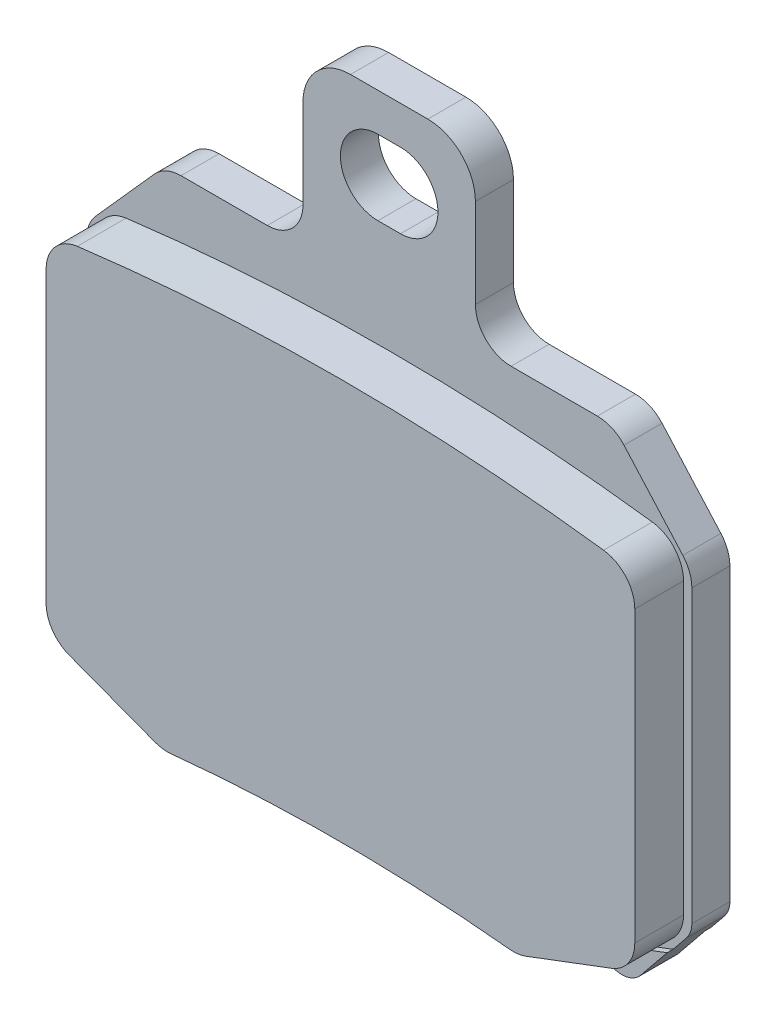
ISO-10303-21;
HEADER;
FILE_DESCRIPTION(('STEP AP214'),'2;1');
FILE_NAME('part.step','',(''),(''),'','','');
FILE_SCHEMA(('AUTOMOTIVE_DESIGN { 1 0 10303 214 1 1 1 1 }'));
ENDSEC;
DATA;
#1=APPLICATION_CONTEXT('core data for automotive mechanical design processes');
#2=APPLICATION_PROTOCOL_DEFINITION('international standard','automotive_design',2000,#1);
#3=PRODUCT_CONTEXT('',#1,'mechanical');
#4=PRODUCT('Part','Part','',(#3));
#5=PRODUCT_RELATED_PRODUCT_CATEGORY('part','',(#4));
#6=PRODUCT_DEFINITION_FORMATION('','',#4);
#7=PRODUCT_DEFINITION_CONTEXT('part definition',#1,'design');
#8=PRODUCT_DEFINITION('design','',#6,#7);
#9=PRODUCT_DEFINITION_SHAPE('','',#8);
#10=(LENGTH_UNIT() NAMED_UNIT(*) SI_UNIT(.MILLI.,.METRE.));
#11=(NAMED_UNIT(*) PLANE_ANGLE_UNIT() SI_UNIT($,.RADIAN.));
#12=(NAMED_UNIT(*) SI_UNIT($,.STERADIAN.) SOLID_ANGLE_UNIT());
#13=UNCERTAINTY_MEASURE_WITH_UNIT(LENGTH_MEASURE(1.E-05),#10,'distance_accuracy_value','');
#14=(GEOMETRIC_REPRESENTATION_CONTEXT(3) GLOBAL_UNCERTAINTY_ASSIGNED_CONTEXT((#13)) GLOBAL_UNIT_ASSIGNED_CONTEXT((#10,
#11,#12)) REPRESENTATION_CONTEXT('',''));
#15=CARTESIAN_POINT('',(0.,0.,0.));
#16=DIRECTION('',(0.,0.,1.));
#17=DIRECTION('',(1.,0.,0.));
#18=AXIS2_PLACEMENT_3D('',#15,#16,#17);
#19=CARTESIAN_POINT('',(4.55,-53.8187820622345,3.2));
#20=DIRECTION('',(-0.17020949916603,0.985407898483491,0.));
#21=DIRECTION('',(-0.985407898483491,-0.17020949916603,0.));
#22=AXIS2_PLACEMENT_3D('',#19,#20,#21);
#23=PLANE('',#22);
#24=DIRECTION('',(-0.985407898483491,-0.17020949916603,0.));
#25=VECTOR('',#24,1.);
#26=CARTESIAN_POINT('',(8.64076005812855,-53.1121851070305,0.5));
#27=LINE('',#26,#25);
#28=CARTESIAN_POINT('',(8.64076005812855,-53.1121851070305,0.5));
#29=VERTEX_POINT('',#28);
#30=CARTESIAN_POINT('',(5.70627076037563,-53.6190594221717,0.5));
#31=VERTEX_POINT('',#30);
#32=EDGE_CURVE('E863',#29,#31,#27,.T.);
#33=ORIENTED_EDGE('',*,*,#32,.F.);
#34=DIRECTION('',(0.,0.,-1.));
#35=VECTOR('',#34,1.);
#36=CARTESIAN_POINT('',(8.64076005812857,-53.1121851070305,3.2));
#37=LINE('',#36,#35);
#38=CARTESIAN_POINT('',(8.64076005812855,-53.1121851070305,3.7));
#39=VERTEX_POINT('',#38);
#40=EDGE_CURVE('E819',#29,#39,#37,.F.);
#41=ORIENTED_EDGE('',*,*,#40,.T.);
#42=DIRECTION('',(0.985407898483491,0.170209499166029,0.));
#43=VECTOR('',#42,1.);
#44=CARTESIAN_POINT('',(8.64076005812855,-53.1121851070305,3.7));
#45=LINE('',#44,#43);
#46=CARTESIAN_POINT('',(5.70627076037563,-53.6190594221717,3.7));
#47=VERTEX_POINT('',#46);
#48=EDGE_CURVE('E870',#47,#39,#45,.T.);
#49=ORIENTED_EDGE('',*,*,#48,.F.);
#50=DIRECTION('',(0.,0.,-1.));
#51=VECTOR('',#50,1.);
#52=CARTESIAN_POINT('',(5.70627076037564,-53.6190594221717,3.2));
#53=LINE('',#52,#51);
#54=EDGE_CURVE('E821',#47,#31,#53,.T.);
#55=ORIENTED_EDGE('',*,*,#54,.T.);
#56=EDGE_LOOP('',(#33,#41,#49,#55));
#57=FACE_BOUND('',#56,.T.);
#58=ADVANCED_FACE('F110',(#57),#23,.F.);
#59=CARTESIAN_POINT('',(46.35,-53.8187820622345,3.2));
#60=DIRECTION('',(0.170209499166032,0.98540789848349,0.));
#61=DIRECTION('',(-0.98540789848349,0.170209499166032,0.));
#62=AXIS2_PLACEMENT_3D('',#59,#60,#61);
#63=PLANE('',#62);
#64=DIRECTION('',(-0.98540789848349,0.170209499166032,0.));
#65=VECTOR('',#64,1.);
#66=CARTESIAN_POINT('',(45.1937292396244,-53.6190594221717,0.5));
#67=LINE('',#66,#65);
#68=CARTESIAN_POINT('',(45.1937292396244,-53.6190594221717,0.5));
#69=VERTEX_POINT('',#68);
#70=CARTESIAN_POINT('',(42.2592399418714,-53.1121851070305,0.5));
#71=VERTEX_POINT('',#70);
#72=EDGE_CURVE('E447',#69,#71,#67,.T.);
#73=ORIENTED_EDGE('',*,*,#72,.F.);
#74=DIRECTION('',(0.,0.,-1.));
#75=VECTOR('',#74,1.);
#76=CARTESIAN_POINT('',(45.1937292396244,-53.6190594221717,3.2));
#77=LINE('',#76,#75);
#78=CARTESIAN_POINT('',(45.1937292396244,-53.6190594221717,3.7));
#79=VERTEX_POINT('',#78);
#80=EDGE_CURVE('E458',#69,#79,#77,.F.);
#81=ORIENTED_EDGE('',*,*,#80,.T.);
#82=DIRECTION('',(0.985407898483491,-0.170209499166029,0.));
#83=VECTOR('',#82,1.);
#84=CARTESIAN_POINT('',(42.2592399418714,-53.1121851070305,3.7));
#85=LINE('',#84,#83);
#86=CARTESIAN_POINT('',(42.2592399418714,-53.1121851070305,3.7));
#87=VERTEX_POINT('',#86);
#88=EDGE_CURVE('E492',#87,#79,#85,.T.);
#89=ORIENTED_EDGE('',*,*,#88,.F.);
#90=DIRECTION('',(0.,0.,-1.));
#91=VECTOR('',#90,1.);
#92=CARTESIAN_POINT('',(42.2592399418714,-53.1121851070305,0.));
#93=LINE('',#92,#91);
#94=EDGE_CURVE('E460',#87,#71,#93,.T.);
#95=ORIENTED_EDGE('',*,*,#94,.T.);
#96=EDGE_LOOP('',(#73,#81,#89,#95));
#97=FACE_BOUND('',#96,.T.);
#98=ADVANCED_FACE('F456',(#97),#63,.F.);
#99=CARTESIAN_POINT('',(5.36585176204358,-51.6482436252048,3.2));
#100=DIRECTION('',(0.,0.,-1.));
#101=DIRECTION('',(-1.,0.,0.));
#102=AXIS2_PLACEMENT_3D('',#99,#100,#101);
#103=CYLINDRICAL_SURFACE('',#102,2.);
#104=DIRECTION('',(0.,0.,-1.));
#105=VECTOR('',#104,1.);
#106=CARTESIAN_POINT('',(3.81155983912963,-52.9068844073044,3.2));
#107=LINE('',#106,#105);
#108=CARTESIAN_POINT('',(3.81155983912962,-52.9068844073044,0.5));
#109=VERTEX_POINT('',#108);
#110=CARTESIAN_POINT('',(3.81155983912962,-52.9068844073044,3.7));
#111=VERTEX_POINT('',#110);
#112=EDGE_CURVE('E795',#109,#111,#107,.F.);
#113=ORIENTED_EDGE('',*,*,#112,.F.);
#114=CARTESIAN_POINT('',(5.36585176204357,-51.6482436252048,0.5));
#115=DIRECTION('',(0.,0.,-1.));
#116=DIRECTION('',(-1.,0.,0.));
#117=AXIS2_PLACEMENT_3D('',#114,#115,#116);
#118=CIRCLE('',#117,2.);
#119=EDGE_CURVE('E856',#31,#109,#118,.T.);
#120=ORIENTED_EDGE('',*,*,#119,.F.);
#121=ORIENTED_EDGE('',*,*,#54,.F.);
#122=CARTESIAN_POINT('',(5.36585176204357,-51.6482436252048,3.7));
#123=DIRECTION('',(0.,0.,1.));
#124=DIRECTION('',(-1.,0.,0.));
#125=AXIS2_PLACEMENT_3D('',#122,#123,#124);
#126=CIRCLE('',#125,2.);
#127=EDGE_CURVE('E867',#111,#47,#126,.T.);
#128=ORIENTED_EDGE('',*,*,#127,.F.);
#129=EDGE_LOOP('',(#113,#120,#121,#128));
#130=FACE_BOUND('',#129,.T.);
#131=ADVANCED_FACE('F1009',(#130),#103,.T.);
#132=CARTESIAN_POINT('',(8.98117905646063,-55.0830009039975,3.2));
#133=DIRECTION('',(0.,0.,1.));
#134=DIRECTION('',(1.,0.,0.));
#135=AXIS2_PLACEMENT_3D('',#132,#133,#134);
#136=CYLINDRICAL_SURFACE('',#135,2.);
#137=CARTESIAN_POINT('',(8.98117905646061,-55.0830009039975,0.5));
#138=DIRECTION('',(0.,0.,1.));
#139=DIRECTION('',(-1.,0.,0.));
#140=AXIS2_PLACEMENT_3D('',#137,#138,#139);
#141=CIRCLE('',#140,1.99999999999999);
#142=CARTESIAN_POINT('',(9.68812874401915,-53.2121128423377,0.5));
#143=VERTEX_POINT('',#142);
#144=EDGE_CURVE('E861',#143,#29,#141,.T.);
#145=ORIENTED_EDGE('',*,*,#144,.F.);
#146=DIRECTION('',(0.,0.,-1.));
#147=VECTOR('',#146,1.);
#148=CARTESIAN_POINT('',(9.68812874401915,-53.2121128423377,0.));
#149=LINE('',#148,#147);
#150=CARTESIAN_POINT('',(9.68812874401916,-53.2121128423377,3.2));
#151=VERTEX_POINT('',#150);
#152=EDGE_CURVE('E826',#151,#143,#149,.T.);
#153=ORIENTED_EDGE('',*,*,#152,.F.);
#154=DIRECTION('',(0.,0.,-1.));
#155=VECTOR('',#154,1.);
#156=CARTESIAN_POINT('',(9.68812874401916,-53.2121128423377,3.7));
#157=LINE('',#156,#155);
#158=CARTESIAN_POINT('',(9.68812874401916,-53.2121128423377,3.7));
#159=VERTEX_POINT('',#158);
#160=EDGE_CURVE('E496',#159,#151,#157,.T.);
#161=ORIENTED_EDGE('',*,*,#160,.F.);
#162=CARTESIAN_POINT('',(8.98117905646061,-55.0830009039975,3.7));
#163=DIRECTION('',(0.,0.,-1.));
#164=DIRECTION('',(1.,0.,0.));
#165=AXIS2_PLACEMENT_3D('',#162,#163,#164);
#166=CIRCLE('',#165,2.);
#167=EDGE_CURVE('E873',#39,#159,#166,.T.);
#168=ORIENTED_EDGE('',*,*,#167,.F.);
#169=ORIENTED_EDGE('',*,*,#40,.F.);
#170=EDGE_LOOP('',(#145,#153,#161,#168,#169));
#171=FACE_BOUND('',#170,.T.);
#172=ADVANCED_FACE('F894',(#171),#136,.F.);
#173=CARTESIAN_POINT('',(41.9188209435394,-55.0830009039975,3.2));
#174=DIRECTION('',(0.,0.,1.));
#175=DIRECTION('',(1.,0.,0.));
#176=AXIS2_PLACEMENT_3D('',#173,#174,#175);
#177=CYLINDRICAL_SURFACE('',#176,2.);
#178=CARTESIAN_POINT('',(41.9188209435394,-55.0830009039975,0.5));
#179=DIRECTION('',(0.,0.,1.));
#180=DIRECTION('',(-1.,0.,0.));
#181=AXIS2_PLACEMENT_3D('',#178,#179,#180);
#182=CIRCLE('',#181,2.);
#183=CARTESIAN_POINT('',(41.2118712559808,-53.2121128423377,0.5));
#184=VERTEX_POINT('',#183);
#185=EDGE_CURVE('E461',#71,#184,#182,.T.);
#186=ORIENTED_EDGE('',*,*,#185,.F.);
#187=ORIENTED_EDGE('',*,*,#94,.F.);
#188=CARTESIAN_POINT('',(41.9188209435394,-55.0830009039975,3.7));
#189=DIRECTION('',(0.,0.,-1.));
#190=DIRECTION('',(-1.,0.,0.));
#191=AXIS2_PLACEMENT_3D('',#188,#189,#190);
#192=CIRCLE('',#191,2.);
#193=CARTESIAN_POINT('',(41.2118712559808,-53.2121128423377,3.7));
#194=VERTEX_POINT('',#193);
#195=EDGE_CURVE('E502',#194,#87,#192,.T.);
#196=ORIENTED_EDGE('',*,*,#195,.F.);
#197=DIRECTION('',(0.,0.,-1.));
#198=VECTOR('',#197,1.);
#199=CARTESIAN_POINT('',(41.2118712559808,-53.2121128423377,3.7));
#200=LINE('',#199,#198);
#201=CARTESIAN_POINT('',(41.2118712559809,-53.2121128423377,3.2));
#202=VERTEX_POINT('',#201);
#203=EDGE_CURVE('E504',#194,#202,#200,.T.);
#204=ORIENTED_EDGE('',*,*,#203,.T.);
#205=DIRECTION('',(0.,0.,-1.));
#206=VECTOR('',#205,1.);
#207=CARTESIAN_POINT('',(41.2118712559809,-53.2121128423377,3.2));
#208=LINE('',#207,#206);
#209=EDGE_CURVE('E472',#184,#202,#208,.F.);
#210=ORIENTED_EDGE('',*,*,#209,.F.);
#211=EDGE_LOOP('',(#186,#187,#196,#204,#210));
#212=FACE_BOUND('',#211,.T.);
#213=ADVANCED_FACE('F848',(#212),#177,.F.);
#214=CARTESIAN_POINT('',(45.5341482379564,-51.6482436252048,3.2));
#215=DIRECTION('',(0.,0.,-1.));
#216=DIRECTION('',(-1.,0.,0.));
#217=AXIS2_PLACEMENT_3D('',#214,#215,#216);
#218=CYLINDRICAL_SURFACE('',#217,2.);
#219=ORIENTED_EDGE('',*,*,#80,.F.);
#220=CARTESIAN_POINT('',(45.5341482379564,-51.6482436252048,0.5));
#221=DIRECTION('',(0.,0.,-1.));
#222=DIRECTION('',(-1.,0.,0.));
#223=AXIS2_PLACEMENT_3D('',#220,#221,#222);
#224=CIRCLE('',#223,2.);
#225=CARTESIAN_POINT('',(47.0884401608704,-52.9068844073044,0.5));
#226=VERTEX_POINT('',#225);
#227=EDGE_CURVE('E443',#226,#69,#224,.T.);
#228=ORIENTED_EDGE('',*,*,#227,.F.);
#229=DIRECTION('',(0.,0.,-1.));
#230=VECTOR('',#229,1.);
#231=CARTESIAN_POINT('',(47.0884401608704,-52.9068844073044,3.2));
#232=LINE('',#231,#230);
#233=CARTESIAN_POINT('',(47.0884401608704,-52.9068844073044,3.7));
#234=VERTEX_POINT('',#233);
#235=EDGE_CURVE('E118',#234,#226,#232,.T.);
#236=ORIENTED_EDGE('',*,*,#235,.F.);
#237=CARTESIAN_POINT('',(45.5341482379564,-51.6482436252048,3.7));
#238=DIRECTION('',(0.,0.,1.));
#239=DIRECTION('',(1.,0.,0.));
#240=AXIS2_PLACEMENT_3D('',#237,#238,#239);
#241=CIRCLE('',#240,2.);
#242=EDGE_CURVE('E466',#79,#234,#241,.T.);
#243=ORIENTED_EDGE('',*,*,#242,.F.);
#244=EDGE_LOOP('',(#219,#228,#236,#243));
#245=FACE_BOUND('',#244,.T.);
#246=ADVANCED_FACE('F464',(#245),#218,.T.);
#247=CARTESIAN_POINT('',(25.45,-193.725000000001,3.2));
#248=DIRECTION('',(0.,0.,-1.));
#249=DIRECTION('',(-1.,0.,0.));
#250=AXIS2_PLACEMENT_3D('',#247,#248,#249);
#251=PLANE('',#250);
#252=CARTESIAN_POINT('',(26.4,-6.35,3.2));
#253=DIRECTION('',(0.,0.,1.));
#254=DIRECTION('',(1.,0.,0.));
#255=AXIS2_PLACEMENT_3D('',#252,#253,#254);
#256=CIRCLE('',#255,3.15);
#257=CARTESIAN_POINT('',(26.4,-9.50000000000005,3.2));
#258=VERTEX_POINT('',#257);
#259=CARTESIAN_POINT('',(26.4,-3.2,3.2));
#260=VERTEX_POINT('',#259);
#261=EDGE_CURVE('E590',#258,#260,#256,.T.);
#262=ORIENTED_EDGE('',*,*,#261,.F.);
#263=DIRECTION('',(1.,0.,0.));
#264=VECTOR('',#263,1.);
#265=CARTESIAN_POINT('',(24.5,-9.50000000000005,3.2));
#266=LINE('',#265,#264);
#267=CARTESIAN_POINT('',(24.5,-9.5,3.2));
#268=VERTEX_POINT('',#267);
#269=EDGE_CURVE('E561',#268,#258,#266,.T.);
#270=ORIENTED_EDGE('',*,*,#269,.F.);
#271=CARTESIAN_POINT('',(24.5,-6.35,3.2));
#272=DIRECTION('',(0.,0.,1.));
#273=DIRECTION('',(1.,0.,0.));
#274=AXIS2_PLACEMENT_3D('',#271,#272,#273);
#275=CIRCLE('',#274,3.15);
#276=CARTESIAN_POINT('',(24.5,-3.2,3.2));
#277=VERTEX_POINT('',#276);
#278=EDGE_CURVE('E579',#277,#268,#275,.T.);
#279=ORIENTED_EDGE('',*,*,#278,.F.);
#280=DIRECTION('',(1.,0.,0.));
#281=VECTOR('',#280,1.);
#282=CARTESIAN_POINT('',(24.5,-3.2,3.2));
#283=LINE('',#282,#281);
#284=EDGE_CURVE('E576',#277,#260,#283,.T.);
#285=ORIENTED_EDGE('',*,*,#284,.T.);
#286=EDGE_LOOP('',(#262,#270,#279,#285));
#287=FACE_BOUND('',#286,.T.);
#288=DIRECTION('',(0.935444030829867,-0.353474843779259,0.));
#289=VECTOR('',#288,1.);
#290=CARTESIAN_POINT('',(0.700000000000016,-49.2812764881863,3.2));
#291=LINE('',#290,#289);
#292=CARTESIAN_POINT('',(2.63957546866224,-50.0141809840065,3.2));
#293=VERTEX_POINT('',#292);
#294=CARTESIAN_POINT('',(9.85162307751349,-52.7393866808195,3.2));
#295=VERTEX_POINT('',#294);
#296=EDGE_CURVE('E550',#293,#295,#291,.T.);
#297=ORIENTED_EDGE('',*,*,#296,.F.);
#298=CARTESIAN_POINT('',(3.70000000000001,-47.2078488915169,3.2));
#299=DIRECTION('',(0.,0.,-1.));
#300=DIRECTION('',(-1.,0.,0.));
#301=AXIS2_PLACEMENT_3D('',#298,#299,#300);
#302=CIRCLE('',#301,3.);
#303=CARTESIAN_POINT('',(0.700000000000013,-47.2078488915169,3.2));
#304=VERTEX_POINT('',#303);
#305=EDGE_CURVE('E755',#293,#304,#302,.T.);
#306=ORIENTED_EDGE('',*,*,#305,.T.);
#307=DIRECTION('',(0.,-1.,0.));
#308=VECTOR('',#307,1.);
#309=CARTESIAN_POINT('',(0.699999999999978,-20.2567374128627,3.2));
#310=LINE('',#309,#308);
#311=CARTESIAN_POINT('',(0.699999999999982,-22.8789051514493,3.2));
#312=VERTEX_POINT('',#311);
#313=EDGE_CURVE('E526',#312,#304,#310,.T.);
#314=ORIENTED_EDGE('',*,*,#313,.F.);
#315=CARTESIAN_POINT('',(3.69999999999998,-22.8789051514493,3.2));
#316=DIRECTION('',(0.,0.,-1.));
#317=DIRECTION('',(-1.,0.,0.));
#318=AXIS2_PLACEMENT_3D('',#315,#316,#317);
#319=CIRCLE('',#318,3.);
#320=CARTESIAN_POINT('',(3.32113514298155,-19.902924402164,3.2));
#321=VERTEX_POINT('',#320);
#322=EDGE_CURVE('E719',#312,#321,#319,.T.);
#323=ORIENTED_EDGE('',*,*,#322,.T.);
#324=CARTESIAN_POINT('',(25.45,-193.725000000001,3.2));
#325=DIRECTION('',(0.,0.,1.));
#326=DIRECTION('',(1.,0.,0.));
#327=AXIS2_PLACEMENT_3D('',#324,#325,#326);
#328=CIRCLE('',#327,175.225000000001);
#329=CARTESIAN_POINT('',(47.5788648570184,-19.902924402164,3.2));
#330=VERTEX_POINT('',#329);
#331=EDGE_CURVE('E546',#330,#321,#328,.T.);
#332=ORIENTED_EDGE('',*,*,#331,.F.);
#333=CARTESIAN_POINT('',(47.2,-22.8789051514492,3.2));
#334=DIRECTION('',(0.,0.,-1.));
#335=DIRECTION('',(-1.,0.,0.));
#336=AXIS2_PLACEMENT_3D('',#333,#334,#335);
#337=CIRCLE('',#336,3.);
#338=CARTESIAN_POINT('',(50.2,-22.8789051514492,3.2));
#339=VERTEX_POINT('',#338);
#340=EDGE_CURVE('E716',#330,#339,#337,.T.);
#341=ORIENTED_EDGE('',*,*,#340,.T.);
#342=DIRECTION('',(0.,1.,0.));
#343=VECTOR('',#342,1.);
#344=CARTESIAN_POINT('',(50.2,-20.2567374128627,3.2));
#345=LINE('',#344,#343);
#346=CARTESIAN_POINT('',(50.2,-47.2078488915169,3.2));
#347=VERTEX_POINT('',#346);
#348=EDGE_CURVE('E547',#347,#339,#345,.T.);
#349=ORIENTED_EDGE('',*,*,#348,.F.);
#350=CARTESIAN_POINT('',(47.2,-47.2078488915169,3.2));
#351=DIRECTION('',(0.,0.,-1.));
#352=DIRECTION('',(-1.,0.,0.));
#353=AXIS2_PLACEMENT_3D('',#350,#351,#352);
#354=CIRCLE('',#353,3.);
#355=CARTESIAN_POINT('',(48.2604245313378,-50.0141809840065,3.2));
#356=VERTEX_POINT('',#355);
#357=EDGE_CURVE('E749',#347,#356,#354,.T.);
#358=ORIENTED_EDGE('',*,*,#357,.T.);
#359=DIRECTION('',(0.935444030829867,0.353474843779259,0.));
#360=VECTOR('',#359,1.);
#361=CARTESIAN_POINT('',(50.2,-49.2812764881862,3.2));
#362=LINE('',#361,#360);
#363=CARTESIAN_POINT('',(41.0483769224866,-52.7393866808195,3.2));
#364=VERTEX_POINT('',#363);
#365=EDGE_CURVE('E543',#364,#356,#362,.T.);
#366=ORIENTED_EDGE('',*,*,#365,.F.);
#367=CARTESIAN_POINT('',(39.9879523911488,-49.9330545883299,3.2));
#368=DIRECTION('',(0.,0.,-1.));
#369=DIRECTION('',(-1.,0.,0.));
#370=AXIS2_PLACEMENT_3D('',#367,#368,#369);
#371=CIRCLE('',#370,3.);
#372=CARTESIAN_POINT('',(39.686178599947,-52.91783809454,3.2));
#373=VERTEX_POINT('',#372);
#374=EDGE_CURVE('E751',#364,#373,#371,.T.);
#375=ORIENTED_EDGE('',*,*,#374,.T.);
#376=CARTESIAN_POINT('',(25.45,-193.725000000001,3.2));
#377=DIRECTION('',(0.,0.,-1.));
#378=DIRECTION('',(1.,0.,0.));
#379=AXIS2_PLACEMENT_3D('',#376,#377,#378);
#380=CIRCLE('',#379,141.525000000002);
#381=CARTESIAN_POINT('',(11.2138214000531,-52.91783809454,3.2));
#382=VERTEX_POINT('',#381);
#383=EDGE_CURVE('E521',#382,#373,#380,.T.);
#384=ORIENTED_EDGE('',*,*,#383,.F.);
#385=CARTESIAN_POINT('',(10.9120476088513,-49.9330545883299,3.2));
#386=DIRECTION('',(0.,0.,-1.));
#387=DIRECTION('',(-1.,0.,0.));
#388=AXIS2_PLACEMENT_3D('',#385,#386,#387);
#389=CIRCLE('',#388,3.);
#390=EDGE_CURVE('E753',#382,#295,#389,.T.);
#391=ORIENTED_EDGE('',*,*,#390,.T.);
#392=EDGE_LOOP('',(#297,#306,#314,#323,#332,#341,#349,#358,#366,#375,#384,#391));
#393=FACE_BOUND('',#392,.T.);
#394=DIRECTION('',(-0.935444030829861,0.353474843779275,0.));
#395=VECTOR('',#394,1.);
#396=CARTESIAN_POINT('',(9.68812874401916,-53.2121128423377,3.2));
#397=LINE('',#396,#395);
#398=CARTESIAN_POINT('',(1.57669648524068,-50.1470580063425,3.2));
#399=VERTEX_POINT('',#398);
#400=EDGE_CURVE('E855',#151,#399,#397,.T.);
#401=ORIENTED_EDGE('',*,*,#400,.F.);
#402=DIRECTION('',(0.935444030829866,-0.353474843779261,0.));
#403=VECTOR('',#402,1.);
#404=CARTESIAN_POINT('',(9.1780661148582,-53.0193762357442,3.2));
#405=LINE('',#404,#403);
#406=CARTESIAN_POINT('',(10.0058500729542,-53.3321697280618,3.2));
#407=VERTEX_POINT('',#406);
#408=EDGE_CURVE('E619',#151,#407,#405,.T.);
#409=ORIENTED_EDGE('',*,*,#408,.T.);
#410=CARTESIAN_POINT('',(10.7127997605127,-51.4612816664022,3.2));
#411=DIRECTION('',(0.,0.,-1.));
#412=DIRECTION('',(-1.,0.,0.));
#413=AXIS2_PLACEMENT_3D('',#410,#411,#412);
#414=CIRCLE('',#413,2.);
#415=CARTESIAN_POINT('',(10.9188784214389,-53.4506362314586,3.2));
#416=VERTEX_POINT('',#415);
#417=EDGE_CURVE('E815',#407,#416,#414,.F.);
#418=ORIENTED_EDGE('',*,*,#417,.T.);
#419=CARTESIAN_POINT('',(25.45,-193.725000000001,3.2));
#420=DIRECTION('',(0.,0.,-1.));
#421=DIRECTION('',(-1.,0.,0.));
#422=AXIS2_PLACEMENT_3D('',#419,#420,#421);
#423=CIRCLE('',#422,141.025000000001);
#424=CARTESIAN_POINT('',(39.9811215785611,-53.4506362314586,3.2));
#425=VERTEX_POINT('',#424);
#426=EDGE_CURVE('E622',#416,#425,#423,.T.);
#427=ORIENTED_EDGE('',*,*,#426,.T.);
#428=CARTESIAN_POINT('',(40.1872002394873,-51.4612816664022,3.2));
#429=DIRECTION('',(0.,0.,-1.));
#430=DIRECTION('',(-1.,0.,0.));
#431=AXIS2_PLACEMENT_3D('',#428,#429,#430);
#432=CIRCLE('',#431,2.);
#433=CARTESIAN_POINT('',(40.8941499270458,-53.3321697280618,3.2));
#434=VERTEX_POINT('',#433);
#435=EDGE_CURVE('E813',#425,#434,#432,.F.);
#436=ORIENTED_EDGE('',*,*,#435,.T.);
#437=DIRECTION('',(0.935444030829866,0.35347484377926,0.));
#438=VECTOR('',#437,1.);
#439=CARTESIAN_POINT('',(41.7219338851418,-53.0193762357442,3.2));
#440=LINE('',#439,#438);
#441=EDGE_CURVE('E625',#434,#202,#440,.T.);
#442=ORIENTED_EDGE('',*,*,#441,.T.);
#443=DIRECTION('',(-0.935444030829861,-0.353474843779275,0.));
#444=VECTOR('',#443,1.);
#445=CARTESIAN_POINT('',(41.2118712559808,-53.2121128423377,3.2));
#446=LINE('',#445,#444);
#447=CARTESIAN_POINT('',(49.3233035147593,-50.1470580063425,3.2));
#448=VERTEX_POINT('',#447);
#449=EDGE_CURVE('E493',#448,#202,#446,.T.);
#450=ORIENTED_EDGE('',*,*,#449,.F.);
#451=DIRECTION('',(0.629320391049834,0.777145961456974,0.));
#452=VECTOR('',#451,1.);
#453=CARTESIAN_POINT('',(50.9,-48.2,3.2));
#454=LINE('',#453,#452);
#455=CARTESIAN_POINT('',(50.4542919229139,-48.7504036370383,3.2));
#456=VERTEX_POINT('',#455);
#457=EDGE_CURVE('E628',#448,#456,#454,.T.);
#458=ORIENTED_EDGE('',*,*,#457,.T.);
#459=CARTESIAN_POINT('',(48.9,-47.4917628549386,3.2));
#460=DIRECTION('',(0.,0.,-1.));
#461=DIRECTION('',(-1.,0.,0.));
#462=AXIS2_PLACEMENT_3D('',#459,#460,#461);
#463=CIRCLE('',#462,2.);
#464=CARTESIAN_POINT('',(50.9,-47.4917628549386,3.2));
#465=VERTEX_POINT('',#464);
#466=EDGE_CURVE('E811',#456,#465,#463,.F.);
#467=ORIENTED_EDGE('',*,*,#466,.T.);
#468=DIRECTION('',(0.,1.,0.));
#469=VECTOR('',#468,1.);
#470=CARTESIAN_POINT('',(50.9,-48.2,3.2));
#471=LINE('',#470,#469);
#472=CARTESIAN_POINT('',(50.9,-23.0434746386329,3.2));
#473=VERTEX_POINT('',#472);
#474=EDGE_CURVE('E630',#465,#473,#471,.T.);
#475=ORIENTED_EDGE('',*,*,#474,.T.);
#476=CARTESIAN_POINT('',(47.9,-23.0434746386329,3.2));
#477=DIRECTION('',(0.,0.,-1.));
#478=DIRECTION('',(-1.,0.,0.));
#479=AXIS2_PLACEMENT_3D('',#476,#477,#478);
#480=CIRCLE('',#479,3.);
#481=CARTESIAN_POINT('',(50.1388863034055,-21.0466300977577,3.2));
#482=VERTEX_POINT('',#481);
#483=EDGE_CURVE('E780',#473,#482,#480,.F.);
#484=ORIENTED_EDGE('',*,*,#483,.T.);
#485=DIRECTION('',(-0.665614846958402,0.746295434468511,0.));
#486=VECTOR('',#485,1.);
#487=CARTESIAN_POINT('',(124.977817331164,-104.956946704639,3.2));
#488=LINE('',#487,#486);
#489=CARTESIAN_POINT('',(45.1947062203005,-15.5031554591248,3.2));
#490=VERTEX_POINT('',#489);
#491=EDGE_CURVE('E513',#482,#490,#488,.T.);
#492=ORIENTED_EDGE('',*,*,#491,.T.);
#493=CARTESIAN_POINT('',(42.9558199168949,-17.5,3.2));
#494=DIRECTION('',(0.,0.,-1.));
#495=DIRECTION('',(-1.,0.,0.));
#496=AXIS2_PLACEMENT_3D('',#493,#494,#495);
#497=CIRCLE('',#496,3.);
#498=CARTESIAN_POINT('',(42.9558199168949,-14.5,3.2));
#499=VERTEX_POINT('',#498);
#500=EDGE_CURVE('E778',#490,#499,#497,.F.);
#501=ORIENTED_EDGE('',*,*,#500,.T.);
#502=DIRECTION('',(-1.,0.,0.));
#503=VECTOR('',#502,1.);
#504=CARTESIAN_POINT('',(50.9,-14.5,3.2));
#505=LINE('',#504,#503);
#506=CARTESIAN_POINT('',(35.7,-14.5,3.2));
#507=VERTEX_POINT('',#506);
#508=EDGE_CURVE('E557',#499,#507,#505,.T.);
#509=ORIENTED_EDGE('',*,*,#508,.T.);
#510=CARTESIAN_POINT('',(35.7,-11.5,3.2));
#511=DIRECTION('',(0.,0.,-1.));
#512=DIRECTION('',(-1.,0.,0.));
#513=AXIS2_PLACEMENT_3D('',#510,#511,#512);
#514=CIRCLE('',#513,3.);
#515=CARTESIAN_POINT('',(32.7,-11.5,3.2));
#516=VERTEX_POINT('',#515);
#517=EDGE_CURVE('E676',#507,#516,#514,.T.);
#518=ORIENTED_EDGE('',*,*,#517,.T.);
#519=DIRECTION('',(0.,1.,0.));
#520=VECTOR('',#519,1.);
#521=CARTESIAN_POINT('',(32.7,-14.5,3.2));
#522=LINE('',#521,#520);
#523=CARTESIAN_POINT('',(32.7,-4.,3.2));
#524=VERTEX_POINT('',#523);
#525=EDGE_CURVE('E602',#516,#524,#522,.T.);
#526=ORIENTED_EDGE('',*,*,#525,.T.);
#527=CARTESIAN_POINT('',(28.7,-4.,3.2));
#528=DIRECTION('',(0.,0.,-1.));
#529=DIRECTION('',(-1.,0.,0.));
#530=AXIS2_PLACEMENT_3D('',#527,#528,#529);
#531=CIRCLE('',#530,4.);
#532=CARTESIAN_POINT('',(28.7,0.,3.2));
#533=VERTEX_POINT('',#532);
#534=EDGE_CURVE('E696',#524,#533,#531,.F.);
#535=ORIENTED_EDGE('',*,*,#534,.T.);
#536=DIRECTION('',(-1.,0.,0.));
#537=VECTOR('',#536,1.);
#538=CARTESIAN_POINT('',(18.2,0.,3.2));
#539=LINE('',#538,#537);
#540=CARTESIAN_POINT('',(22.2,0.,3.2));
#541=VERTEX_POINT('',#540);
#542=EDGE_CURVE('E605',#533,#541,#539,.T.);
#543=ORIENTED_EDGE('',*,*,#542,.T.);
#544=CARTESIAN_POINT('',(22.2,-4.,3.2));
#545=DIRECTION('',(0.,0.,-1.));
#546=DIRECTION('',(-1.,0.,0.));
#547=AXIS2_PLACEMENT_3D('',#544,#545,#546);
#548=CIRCLE('',#547,4.);
#549=CARTESIAN_POINT('',(18.2,-4.,3.2));
#550=VERTEX_POINT('',#549);
#551=EDGE_CURVE('E694',#541,#550,#548,.F.);
#552=ORIENTED_EDGE('',*,*,#551,.T.);
#553=DIRECTION('',(0.,-1.,0.));
#554=VECTOR('',#553,1.);
#555=CARTESIAN_POINT('',(18.2,-14.5,3.2));
#556=LINE('',#555,#554);
#557=CARTESIAN_POINT('',(18.2,-11.5,3.2));
#558=VERTEX_POINT('',#557);
#559=EDGE_CURVE('E609',#550,#558,#556,.T.);
#560=ORIENTED_EDGE('',*,*,#559,.T.);
#561=CARTESIAN_POINT('',(15.2,-11.5,3.2));
#562=DIRECTION('',(0.,0.,-1.));
#563=DIRECTION('',(-1.,0.,0.));
#564=AXIS2_PLACEMENT_3D('',#561,#562,#563);
#565=CIRCLE('',#564,3.);
#566=CARTESIAN_POINT('',(15.2,-14.5,3.2));
#567=VERTEX_POINT('',#566);
#568=EDGE_CURVE('E681',#558,#567,#565,.T.);
#569=ORIENTED_EDGE('',*,*,#568,.T.);
#570=DIRECTION('',(-1.,0.,0.));
#571=VECTOR('',#570,1.);
#572=CARTESIAN_POINT('',(0.,-14.5,3.2));
#573=LINE('',#572,#571);
#574=CARTESIAN_POINT('',(7.94418008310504,-14.5,3.2));
#575=VERTEX_POINT('',#574);
#576=EDGE_CURVE('E611',#567,#575,#573,.T.);
#577=ORIENTED_EDGE('',*,*,#576,.T.);
#578=CARTESIAN_POINT('',(7.94418008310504,-17.5,3.2));
#579=DIRECTION('',(0.,0.,-1.));
#580=DIRECTION('',(-1.,0.,0.));
#581=AXIS2_PLACEMENT_3D('',#578,#579,#580);
#582=CIRCLE('',#581,3.);
#583=CARTESIAN_POINT('',(5.70529377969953,-15.5031554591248,3.2));
#584=VERTEX_POINT('',#583);
#585=EDGE_CURVE('E774',#575,#584,#582,.F.);
#586=ORIENTED_EDGE('',*,*,#585,.T.);
#587=DIRECTION('',(-0.665614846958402,-0.746295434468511,0.));
#588=VECTOR('',#587,1.);
#589=CARTESIAN_POINT('',(-74.0778173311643,-104.956946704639,3.2));
#590=LINE('',#589,#588);
#591=CARTESIAN_POINT('',(0.761113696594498,-21.0466300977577,3.2));
#592=VERTEX_POINT('',#591);
#593=EDGE_CURVE('E518',#584,#592,#590,.T.);
#594=ORIENTED_EDGE('',*,*,#593,.T.);
#595=CARTESIAN_POINT('',(3.,-23.0434746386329,3.2));
#596=DIRECTION('',(0.,0.,-1.));
#597=DIRECTION('',(-1.,0.,0.));
#598=AXIS2_PLACEMENT_3D('',#595,#596,#597);
#599=CIRCLE('',#598,3.);
#600=CARTESIAN_POINT('',(0.,-23.0434746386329,3.2));
#601=VERTEX_POINT('',#600);
#602=EDGE_CURVE('E776',#592,#601,#599,.F.);
#603=ORIENTED_EDGE('',*,*,#602,.T.);
#604=DIRECTION('',(0.,-1.,0.));
#605=VECTOR('',#604,1.);
#606=CARTESIAN_POINT('',(0.,-48.2,3.2));
#607=LINE('',#606,#605);
#608=CARTESIAN_POINT('',(0.,-47.4917628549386,3.2));
#609=VERTEX_POINT('',#608);
#610=EDGE_CURVE('E614',#601,#609,#607,.T.);
#611=ORIENTED_EDGE('',*,*,#610,.T.);
#612=CARTESIAN_POINT('',(2.,-47.4917628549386,3.2));
#613=DIRECTION('',(0.,0.,-1.));
#614=DIRECTION('',(-1.,0.,0.));
#615=AXIS2_PLACEMENT_3D('',#612,#613,#614);
#616=CIRCLE('',#615,2.);
#617=CARTESIAN_POINT('',(0.44570807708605,-48.7504036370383,3.2));
#618=VERTEX_POINT('',#617);
#619=EDGE_CURVE('E817',#609,#618,#616,.F.);
#620=ORIENTED_EDGE('',*,*,#619,.T.);
#621=DIRECTION('',(0.629320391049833,-0.777145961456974,0.));
#622=VECTOR('',#621,1.);
#623=CARTESIAN_POINT('',(0.,-48.2,3.2));
#624=LINE('',#623,#622);
#625=EDGE_CURVE('E617',#618,#399,#624,.T.);
#626=ORIENTED_EDGE('',*,*,#625,.T.);
#627=EDGE_LOOP('',(#401,#409,#418,#427,#436,#442,#450,#458,#467,#475,#484,#492,#501,#509,#518,
#526,#535,#543,#552,#560,#569,#577,#586,#594,#603,#611,#620,#626));
#628=FACE_BOUND('',#627,.T.);
#629=ADVANCED_FACE('F842',(#287,#393,#628),#251,.F.);
#630=CARTESIAN_POINT('',(32.7,-14.5,3.2));
#631=DIRECTION('',(-1.,0.,0.));
#632=DIRECTION('',(0.,0.,1.));
#633=AXIS2_PLACEMENT_3D('',#630,#631,#632);
#634=PLANE('',#633);
#635=DIRECTION('',(0.,1.,0.));
#636=VECTOR('',#635,1.);
#637=CARTESIAN_POINT('',(32.7,-14.5,0.));
#638=LINE('',#637,#636);
#639=CARTESIAN_POINT('',(32.7,-11.5,0.));
#640=VERTEX_POINT('',#639);
#641=CARTESIAN_POINT('',(32.7,-4.,0.));
#642=VERTEX_POINT('',#641);
#643=EDGE_CURVE('E601',#640,#642,#638,.T.);
#644=ORIENTED_EDGE('',*,*,#643,.T.);
#645=DIRECTION('',(0.,0.,-1.));
#646=VECTOR('',#645,1.);
#647=CARTESIAN_POINT('',(32.7,-4.,3.2));
#648=LINE('',#647,#646);
#649=EDGE_CURVE('E692',#642,#524,#648,.F.);
#650=ORIENTED_EDGE('',*,*,#649,.T.);
#651=ORIENTED_EDGE('',*,*,#525,.F.);
#652=DIRECTION('',(0.,0.,-1.));
#653=VECTOR('',#652,1.);
#654=CARTESIAN_POINT('',(32.7,-11.5,0.));
#655=LINE('',#654,#653);
#656=EDGE_CURVE('E549',#516,#640,#655,.T.);
#657=ORIENTED_EDGE('',*,*,#656,.T.);
#658=EDGE_LOOP('',(#644,#650,#651,#657));
#659=FACE_BOUND('',#658,.T.);
#660=ADVANCED_FACE('F960',(#659),#634,.F.);
#661=CARTESIAN_POINT('',(18.2,0.,3.2));
#662=DIRECTION('',(0.,-1.,0.));
#663=DIRECTION('',(1.,0.,0.));
#664=AXIS2_PLACEMENT_3D('',#661,#662,#663);
#665=PLANE('',#664);
#666=ORIENTED_EDGE('',*,*,#542,.F.);
#667=DIRECTION('',(0.,0.,-1.));
#668=VECTOR('',#667,1.);
#669=CARTESIAN_POINT('',(28.7,0.,3.2));
#670=LINE('',#669,#668);
#671=CARTESIAN_POINT('',(28.7,0.,0.));
#672=VERTEX_POINT('',#671);
#673=EDGE_CURVE('E685',#533,#672,#670,.T.);
#674=ORIENTED_EDGE('',*,*,#673,.T.);
#675=DIRECTION('',(-1.,0.,0.));
#676=VECTOR('',#675,1.);
#677=CARTESIAN_POINT('',(18.2,0.,0.));
#678=LINE('',#677,#676);
#679=CARTESIAN_POINT('',(22.2,0.,0.));
#680=VERTEX_POINT('',#679);
#681=EDGE_CURVE('E635',#672,#680,#678,.T.);
#682=ORIENTED_EDGE('',*,*,#681,.T.);
#683=DIRECTION('',(0.,0.,-1.));
#684=VECTOR('',#683,1.);
#685=CARTESIAN_POINT('',(22.2,0.,3.2));
#686=LINE('',#685,#684);
#687=EDGE_CURVE('E683',#680,#541,#686,.F.);
#688=ORIENTED_EDGE('',*,*,#687,.T.);
#689=EDGE_LOOP('',(#666,#674,#682,#688));
#690=FACE_BOUND('',#689,.T.);
#691=ADVANCED_FACE('F951',(#690),#665,.F.);
#692=CARTESIAN_POINT('',(18.2,-14.5,3.2));
#693=DIRECTION('',(1.,0.,0.));
#694=DIRECTION('',(0.,0.,-1.));
#695=AXIS2_PLACEMENT_3D('',#692,#693,#694);
#696=PLANE('',#695);
#697=ORIENTED_EDGE('',*,*,#559,.F.);
#698=DIRECTION('',(0.,0.,-1.));
#699=VECTOR('',#698,1.);
#700=CARTESIAN_POINT('',(18.2,-4.,3.2));
#701=LINE('',#700,#699);
#702=CARTESIAN_POINT('',(18.2,-4.,0.));
#703=VERTEX_POINT('',#702);
#704=EDGE_CURVE('E698',#550,#703,#701,.T.);
#705=ORIENTED_EDGE('',*,*,#704,.T.);
#706=DIRECTION('',(0.,-1.,0.));
#707=VECTOR('',#706,1.);
#708=CARTESIAN_POINT('',(18.2,-14.5,0.));
#709=LINE('',#708,#707);
#710=CARTESIAN_POINT('',(18.2,-11.5,0.));
#711=VERTEX_POINT('',#710);
#712=EDGE_CURVE('E638',#703,#711,#709,.T.);
#713=ORIENTED_EDGE('',*,*,#712,.T.);
#714=DIRECTION('',(0.,0.,-1.));
#715=VECTOR('',#714,1.);
#716=CARTESIAN_POINT('',(18.2,-11.5,3.2));
#717=LINE('',#716,#715);
#718=EDGE_CURVE('E670',#711,#558,#717,.F.);
#719=ORIENTED_EDGE('',*,*,#718,.T.);
#720=EDGE_LOOP('',(#697,#705,#713,#719));
#721=FACE_BOUND('',#720,.T.);
#722=ADVANCED_FACE('F943',(#721),#696,.F.);
#723=CARTESIAN_POINT('',(0.,-14.5,3.2));
#724=DIRECTION('',(0.,-1.,0.));
#725=DIRECTION('',(0.,0.,-1.));
#726=AXIS2_PLACEMENT_3D('',#723,#724,#725);
#727=PLANE('',#726);
#728=DIRECTION('',(-1.,0.,0.));
#729=VECTOR('',#728,1.);
#730=CARTESIAN_POINT('',(0.,-14.5,0.));
#731=LINE('',#730,#729);
#732=CARTESIAN_POINT('',(15.2,-14.5,0.));
#733=VERTEX_POINT('',#732);
#734=CARTESIAN_POINT('',(7.94418008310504,-14.5,0.));
#735=VERTEX_POINT('',#734);
#736=EDGE_CURVE('E640',#733,#735,#731,.T.);
#737=ORIENTED_EDGE('',*,*,#736,.T.);
#738=DIRECTION('',(0.,0.,-1.));
#739=VECTOR('',#738,1.);
#740=CARTESIAN_POINT('',(7.94418008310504,-14.5,3.2));
#741=LINE('',#740,#739);
#742=EDGE_CURVE('E793',#735,#575,#741,.F.);
#743=ORIENTED_EDGE('',*,*,#742,.T.);
#744=ORIENTED_EDGE('',*,*,#576,.F.);
#745=DIRECTION('',(0.,0.,-1.));
#746=VECTOR('',#745,1.);
#747=CARTESIAN_POINT('',(15.2,-14.5,0.));
#748=LINE('',#747,#746);
#749=EDGE_CURVE('E667',#567,#733,#748,.T.);
#750=ORIENTED_EDGE('',*,*,#749,.T.);
#751=EDGE_LOOP('',(#737,#743,#744,#750));
#752=FACE_BOUND('',#751,.T.);
#753=ADVANCED_FACE('F932',(#752),#727,.F.);
#754=CARTESIAN_POINT('',(0.,-48.2,3.2));
#755=DIRECTION('',(1.,0.,0.));
#756=DIRECTION('',(0.,0.,-1.));
#757=AXIS2_PLACEMENT_3D('',#754,#755,#756);
#758=PLANE('',#757);
#759=DIRECTION('',(0.,-1.,0.));
#760=VECTOR('',#759,1.);
#761=CARTESIAN_POINT('',(0.,-48.2,0.));
#762=LINE('',#761,#760);
#763=CARTESIAN_POINT('',(0.,-23.0434746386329,0.));
#764=VERTEX_POINT('',#763);
#765=CARTESIAN_POINT('',(0.,-47.4917628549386,0.));
#766=VERTEX_POINT('',#765);
#767=EDGE_CURVE('E643',#764,#766,#762,.T.);
#768=ORIENTED_EDGE('',*,*,#767,.T.);
#769=DIRECTION('',(0.,0.,-1.));
#770=VECTOR('',#769,1.);
#771=CARTESIAN_POINT('',(0.,-47.4917628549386,3.2));
#772=LINE('',#771,#770);
#773=EDGE_CURVE('E809',#766,#609,#772,.F.);
#774=ORIENTED_EDGE('',*,*,#773,.T.);
#775=ORIENTED_EDGE('',*,*,#610,.F.);
#776=DIRECTION('',(0.,0.,-1.));
#777=VECTOR('',#776,1.);
#778=CARTESIAN_POINT('',(0.,-23.0434746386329,3.2));
#779=LINE('',#778,#777);
#780=EDGE_CURVE('E785',#601,#764,#779,.T.);
#781=ORIENTED_EDGE('',*,*,#780,.T.);
#782=EDGE_LOOP('',(#768,#774,#775,#781));
#783=FACE_BOUND('',#782,.T.);
#784=ADVANCED_FACE('F914',(#783),#758,.F.);
#785=CARTESIAN_POINT('',(0.,-48.2,3.2));
#786=DIRECTION('',(0.777145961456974,0.629320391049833,0.));
#787=DIRECTION('',(-0.629320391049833,0.777145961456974,0.));
#788=AXIS2_PLACEMENT_3D('',#785,#786,#787);
#789=PLANE('',#788);
#790=DIRECTION('',(0.629320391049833,-0.777145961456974,0.));
#791=VECTOR('',#790,1.);
#792=CARTESIAN_POINT('',(0.,-48.2,0.));
#793=LINE('',#792,#791);
#794=CARTESIAN_POINT('',(0.44570807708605,-48.7504036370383,0.));
#795=VERTEX_POINT('',#794);
#796=CARTESIAN_POINT('',(1.57669648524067,-50.1470580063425,0.));
#797=VERTEX_POINT('',#796);
#798=EDGE_CURVE('E646',#795,#797,#793,.T.);
#799=ORIENTED_EDGE('',*,*,#798,.T.);
#800=DIRECTION('',(0.,0.,-1.));
#801=VECTOR('',#800,1.);
#802=CARTESIAN_POINT('',(1.57669648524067,-50.1470580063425,0.5));
#803=LINE('',#802,#801);
#804=CARTESIAN_POINT('',(1.57669648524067,-50.1470580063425,0.5));
#805=VERTEX_POINT('',#804);
#806=EDGE_CURVE('E452',#805,#797,#803,.T.);
#807=ORIENTED_EDGE('',*,*,#806,.F.);
#808=DIRECTION('',(-0.629320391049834,0.777145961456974,0.));
#809=VECTOR('',#808,1.);
#810=CARTESIAN_POINT('',(3.81155983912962,-52.9068844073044,0.5));
#811=LINE('',#810,#809);
#812=EDGE_CURVE('E858',#109,#805,#811,.T.);
#813=ORIENTED_EDGE('',*,*,#812,.F.);
#814=ORIENTED_EDGE('',*,*,#112,.T.);
#815=DIRECTION('',(0.629320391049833,-0.777145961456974,0.));
#816=VECTOR('',#815,1.);
#817=CARTESIAN_POINT('',(3.81155983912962,-52.9068844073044,3.7));
#818=LINE('',#817,#816);
#819=CARTESIAN_POINT('',(1.57669648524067,-50.1470580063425,3.7));
#820=VERTEX_POINT('',#819);
#821=EDGE_CURVE('E877',#820,#111,#818,.T.);
#822=ORIENTED_EDGE('',*,*,#821,.F.);
#823=DIRECTION('',(0.,0.,-1.));
#824=VECTOR('',#823,1.);
#825=CARTESIAN_POINT('',(1.57669648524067,-50.1470580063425,3.7));
#826=LINE('',#825,#824);
#827=EDGE_CURVE('E880',#820,#399,#826,.T.);
#828=ORIENTED_EDGE('',*,*,#827,.T.);
#829=ORIENTED_EDGE('',*,*,#625,.F.);
#830=DIRECTION('',(0.,0.,-1.));
#831=VECTOR('',#830,1.);
#832=CARTESIAN_POINT('',(0.44570807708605,-48.7504036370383,3.2));
#833=LINE('',#832,#831);
#834=EDGE_CURVE('E797',#618,#795,#833,.T.);
#835=ORIENTED_EDGE('',*,*,#834,.T.);
#836=EDGE_LOOP('',(#799,#807,#813,#814,#822,#828,#829,#835));
#837=FACE_BOUND('',#836,.T.);
#838=ADVANCED_FACE('F903',(#837),#789,.F.);
#839=CARTESIAN_POINT('',(9.1780661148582,-53.0193762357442,3.2));
#840=DIRECTION('',(0.353474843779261,0.935444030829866,0.));
#841=DIRECTION('',(-0.935444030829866,0.353474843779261,0.));
#842=AXIS2_PLACEMENT_3D('',#839,#840,#841);
#843=PLANE('',#842);
#844=ORIENTED_EDGE('',*,*,#408,.F.);
#845=ORIENTED_EDGE('',*,*,#152,.T.);
#846=DIRECTION('',(0.93544403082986,-0.353474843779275,0.));
#847=VECTOR('',#846,1.);
#848=CARTESIAN_POINT('',(1.57669648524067,-50.1470580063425,0.5));
#849=LINE('',#848,#847);
#850=EDGE_CURVE('E125',#805,#143,#849,.T.);
#851=ORIENTED_EDGE('',*,*,#850,.F.);
#852=ORIENTED_EDGE('',*,*,#806,.T.);
#853=DIRECTION('',(0.935444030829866,-0.353474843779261,0.));
#854=VECTOR('',#853,1.);
#855=CARTESIAN_POINT('',(9.1780661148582,-53.0193762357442,0.));
#856=LINE('',#855,#854);
#857=CARTESIAN_POINT('',(10.0058500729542,-53.3321697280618,0.));
#858=VERTEX_POINT('',#857);
#859=EDGE_CURVE('E649',#797,#858,#856,.T.);
#860=ORIENTED_EDGE('',*,*,#859,.T.);
#861=DIRECTION('',(0.,0.,-1.));
#862=VECTOR('',#861,1.);
#863=CARTESIAN_POINT('',(10.0058500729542,-53.3321697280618,3.2));
#864=LINE('',#863,#862);
#865=EDGE_CURVE('E824',#858,#407,#864,.F.);
#866=ORIENTED_EDGE('',*,*,#865,.T.);
#867=EDGE_LOOP('',(#844,#845,#851,#852,#860,#866));
#868=FACE_BOUND('',#867,.T.);
#869=ADVANCED_FACE('F898',(#868),#843,.F.);
#870=CARTESIAN_POINT('',(25.45,-193.725000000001,3.2));
#871=DIRECTION('',(0.,0.,-1.));
#872=DIRECTION('',(-1.,0.,0.));
#873=AXIS2_PLACEMENT_3D('',#870,#871,#872);
#874=CYLINDRICAL_SURFACE('',#873,141.025000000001);
#875=ORIENTED_EDGE('',*,*,#426,.F.);
#876=DIRECTION('',(0.,0.,-1.));
#877=VECTOR('',#876,1.);
#878=CARTESIAN_POINT('',(10.9188784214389,-53.4506362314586,3.2));
#879=LINE('',#878,#877);
#880=CARTESIAN_POINT('',(10.9188784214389,-53.4506362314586,0.));
#881=VERTEX_POINT('',#880);
#882=EDGE_CURVE('E831',#416,#881,#879,.T.);
#883=ORIENTED_EDGE('',*,*,#882,.T.);
#884=CARTESIAN_POINT('',(25.45,-193.725000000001,0.));
#885=DIRECTION('',(0.,0.,-1.));
#886=DIRECTION('',(-1.,0.,0.));
#887=AXIS2_PLACEMENT_3D('',#884,#885,#886);
#888=CIRCLE('',#887,141.025000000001);
#889=CARTESIAN_POINT('',(39.9811215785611,-53.4506362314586,0.));
#890=VERTEX_POINT('',#889);
#891=EDGE_CURVE('E652',#881,#890,#888,.T.);
#892=ORIENTED_EDGE('',*,*,#891,.T.);
#893=DIRECTION('',(0.,0.,-1.));
#894=VECTOR('',#893,1.);
#895=CARTESIAN_POINT('',(39.9811215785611,-53.4506362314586,3.2));
#896=LINE('',#895,#894);
#897=EDGE_CURVE('E829',#890,#425,#896,.F.);
#898=ORIENTED_EDGE('',*,*,#897,.T.);
#899=EDGE_LOOP('',(#875,#883,#892,#898));
#900=FACE_BOUND('',#899,.T.);
#901=ADVANCED_FACE('F999',(#900),#874,.F.);
#902=CARTESIAN_POINT('',(41.7219338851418,-53.0193762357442,3.2));
#903=DIRECTION('',(-0.35347484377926,0.935444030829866,0.));
#904=DIRECTION('',(-0.935444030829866,-0.35347484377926,0.));
#905=AXIS2_PLACEMENT_3D('',#902,#903,#904);
#906=PLANE('',#905);
#907=ORIENTED_EDGE('',*,*,#441,.F.);
#908=DIRECTION('',(0.,0.,-1.));
#909=VECTOR('',#908,1.);
#910=CARTESIAN_POINT('',(40.8941499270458,-53.3321697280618,3.2));
#911=LINE('',#910,#909);
#912=CARTESIAN_POINT('',(40.8941499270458,-53.3321697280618,0.));
#913=VERTEX_POINT('',#912);
#914=EDGE_CURVE('E467',#434,#913,#911,.T.);
#915=ORIENTED_EDGE('',*,*,#914,.T.);
#916=DIRECTION('',(0.935444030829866,0.35347484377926,0.));
#917=VECTOR('',#916,1.);
#918=CARTESIAN_POINT('',(41.7219338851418,-53.0193762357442,0.));
#919=LINE('',#918,#917);
#920=CARTESIAN_POINT('',(49.3233035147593,-50.1470580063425,0.));
#921=VERTEX_POINT('',#920);
#922=EDGE_CURVE('E655',#913,#921,#919,.T.);
#923=ORIENTED_EDGE('',*,*,#922,.T.);
#924=DIRECTION('',(0.,0.,-1.));
#925=VECTOR('',#924,1.);
#926=CARTESIAN_POINT('',(49.3233035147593,-50.1470580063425,0.5));
#927=LINE('',#926,#925);
#928=CARTESIAN_POINT('',(49.3233035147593,-50.1470580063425,0.5));
#929=VERTEX_POINT('',#928);
#930=EDGE_CURVE('E853',#929,#921,#927,.T.);
#931=ORIENTED_EDGE('',*,*,#930,.F.);
#932=DIRECTION('',(0.93544403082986,0.353474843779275,0.));
#933=VECTOR('',#932,1.);
#934=CARTESIAN_POINT('',(41.2118712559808,-53.2121128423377,0.5));
#935=LINE('',#934,#933);
#936=EDGE_CURVE('E838',#184,#929,#935,.T.);
#937=ORIENTED_EDGE('',*,*,#936,.F.);
#938=ORIENTED_EDGE('',*,*,#209,.T.);
#939=EDGE_LOOP('',(#907,#915,#923,#931,#937,#938));
#940=FACE_BOUND('',#939,.T.);
#941=ADVANCED_FACE('F836',(#940),#906,.F.);
#942=CARTESIAN_POINT('',(50.9,-48.2,3.2));
#943=DIRECTION('',(-0.777145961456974,0.629320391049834,0.));
#944=DIRECTION('',(-0.629320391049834,-0.777145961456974,0.));
#945=AXIS2_PLACEMENT_3D('',#942,#943,#944);
#946=PLANE('',#945);
#947=DIRECTION('',(-0.629320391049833,-0.777145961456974,0.));
#948=VECTOR('',#947,1.);
#949=CARTESIAN_POINT('',(49.3233035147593,-50.1470580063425,0.5));
#950=LINE('',#949,#948);
#951=EDGE_CURVE('E133',#929,#226,#950,.T.);
#952=ORIENTED_EDGE('',*,*,#951,.F.);
#953=ORIENTED_EDGE('',*,*,#930,.T.);
#954=DIRECTION('',(0.629320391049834,0.777145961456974,0.));
#955=VECTOR('',#954,1.);
#956=CARTESIAN_POINT('',(50.9,-48.2,0.));
#957=LINE('',#956,#955);
#958=CARTESIAN_POINT('',(50.4542919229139,-48.7504036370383,0.));
#959=VERTEX_POINT('',#958);
#960=EDGE_CURVE('E657',#921,#959,#957,.T.);
#961=ORIENTED_EDGE('',*,*,#960,.T.);
#962=DIRECTION('',(0.,0.,-1.));
#963=VECTOR('',#962,1.);
#964=CARTESIAN_POINT('',(50.4542919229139,-48.7504036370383,3.2));
#965=LINE('',#964,#963);
#966=EDGE_CURVE('E469',#959,#456,#965,.F.);
#967=ORIENTED_EDGE('',*,*,#966,.T.);
#968=ORIENTED_EDGE('',*,*,#457,.F.);
#969=DIRECTION('',(0.,0.,-1.));
#970=VECTOR('',#969,1.);
#971=CARTESIAN_POINT('',(49.3233035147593,-50.1470580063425,3.7));
#972=LINE('',#971,#970);
#973=CARTESIAN_POINT('',(49.3233035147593,-50.1470580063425,3.7));
#974=VERTEX_POINT('',#973);
#975=EDGE_CURVE('E485',#974,#448,#972,.T.);
#976=ORIENTED_EDGE('',*,*,#975,.F.);
#977=DIRECTION('',(0.629320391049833,0.777145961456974,0.));
#978=VECTOR('',#977,1.);
#979=CARTESIAN_POINT('',(47.0884401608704,-52.9068844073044,3.7));
#980=LINE('',#979,#978);
#981=EDGE_CURVE('E482',#234,#974,#980,.T.);
#982=ORIENTED_EDGE('',*,*,#981,.F.);
#983=ORIENTED_EDGE('',*,*,#235,.T.);
#984=EDGE_LOOP('',(#952,#953,#961,#967,#968,#976,#982,#983));
#985=FACE_BOUND('',#984,.T.);
#986=ADVANCED_FACE('F479',(#985),#946,.F.);
#987=CARTESIAN_POINT('',(50.9,-48.2,3.2));
#988=DIRECTION('',(-1.,0.,0.));
#989=DIRECTION('',(0.,-1.,0.));
#990=AXIS2_PLACEMENT_3D('',#987,#988,#989);
#991=PLANE('',#990);
#992=ORIENTED_EDGE('',*,*,#474,.F.);
#993=DIRECTION('',(0.,0.,-1.));
#994=VECTOR('',#993,1.);
#995=CARTESIAN_POINT('',(50.9,-47.4917628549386,3.2));
#996=LINE('',#995,#994);
#997=CARTESIAN_POINT('',(50.9,-47.4917628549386,0.));
#998=VERTEX_POINT('',#997);
#999=EDGE_CURVE('E13',#465,#998,#996,.T.);
#1000=ORIENTED_EDGE('',*,*,#999,.T.);
#1001=DIRECTION('',(0.,1.,0.));
#1002=VECTOR('',#1001,1.);
#1003=CARTESIAN_POINT('',(50.9,-48.2,0.));
#1004=LINE('',#1003,#1002);
#1005=CARTESIAN_POINT('',(50.9,-23.0434746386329,0.));
#1006=VERTEX_POINT('',#1005);
#1007=EDGE_CURVE('E659',#998,#1006,#1004,.T.);
#1008=ORIENTED_EDGE('',*,*,#1007,.T.);
#1009=DIRECTION('',(0.,0.,-1.));
#1010=VECTOR('',#1009,1.);
#1011=CARTESIAN_POINT('',(50.9,-23.0434746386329,3.2));
#1012=LINE('',#1011,#1010);
#1013=EDGE_CURVE('E771',#1006,#473,#1012,.F.);
#1014=ORIENTED_EDGE('',*,*,#1013,.T.);
#1015=EDGE_LOOP('',(#992,#1000,#1008,#1014));
#1016=FACE_BOUND('',#1015,.T.);
#1017=ADVANCED_FACE('F988',(#1016),#991,.F.);
#1018=CARTESIAN_POINT('',(50.9,-14.5,3.2));
#1019=DIRECTION('',(0.,-1.,0.));
#1020=DIRECTION('',(1.,0.,0.));
#1021=AXIS2_PLACEMENT_3D('',#1018,#1019,#1020);
#1022=PLANE('',#1021);
#1023=ORIENTED_EDGE('',*,*,#508,.F.);
#1024=DIRECTION('',(0.,0.,-1.));
#1025=VECTOR('',#1024,1.);
#1026=CARTESIAN_POINT('',(42.9558199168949,-14.5,3.2));
#1027=LINE('',#1026,#1025);
#1028=CARTESIAN_POINT('',(42.9558199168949,-14.5,0.));
#1029=VERTEX_POINT('',#1028);
#1030=EDGE_CURVE('E782',#499,#1029,#1027,.T.);
#1031=ORIENTED_EDGE('',*,*,#1030,.T.);
#1032=DIRECTION('',(-1.,0.,0.));
#1033=VECTOR('',#1032,1.);
#1034=CARTESIAN_POINT('',(50.9,-14.5,0.));
#1035=LINE('',#1034,#1033);
#1036=CARTESIAN_POINT('',(35.7,-14.5,0.));
#1037=VERTEX_POINT('',#1036);
#1038=EDGE_CURVE('E606',#1029,#1037,#1035,.T.);
#1039=ORIENTED_EDGE('',*,*,#1038,.T.);
#1040=DIRECTION('',(0.,0.,-1.));
#1041=VECTOR('',#1040,1.);
#1042=CARTESIAN_POINT('',(35.7,-14.5,3.2));
#1043=LINE('',#1042,#1041);
#1044=EDGE_CURVE('E664',#1037,#507,#1043,.F.);
#1045=ORIENTED_EDGE('',*,*,#1044,.T.);
#1046=EDGE_LOOP('',(#1023,#1031,#1039,#1045));
#1047=FACE_BOUND('',#1046,.T.);
#1048=ADVANCED_FACE('F970',(#1047),#1022,.F.);
#1049=CARTESIAN_POINT('',(25.45,-193.725000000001,0.));
#1050=DIRECTION('',(0.,0.,-1.));
#1051=DIRECTION('',(-1.,0.,0.));
#1052=AXIS2_PLACEMENT_3D('',#1049,#1050,#1051);
#1053=PLANE('',#1052);
#1054=ORIENTED_EDGE('',*,*,#960,.F.);
#1055=ORIENTED_EDGE('',*,*,#922,.F.);
#1056=CARTESIAN_POINT('',(40.1872002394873,-51.4612816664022,0.));
#1057=DIRECTION('',(0.,0.,-1.));
#1058=DIRECTION('',(-1.,0.,0.));
#1059=AXIS2_PLACEMENT_3D('',#1056,#1057,#1058);
#1060=CIRCLE('',#1059,2.);
#1061=EDGE_CURVE('E803',#913,#890,#1060,.T.);
#1062=ORIENTED_EDGE('',*,*,#1061,.T.);
#1063=ORIENTED_EDGE('',*,*,#891,.F.);
#1064=CARTESIAN_POINT('',(10.7127997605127,-51.4612816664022,0.));
#1065=DIRECTION('',(0.,0.,-1.));
#1066=DIRECTION('',(-1.,0.,0.));
#1067=AXIS2_PLACEMENT_3D('',#1064,#1065,#1066);
#1068=CIRCLE('',#1067,2.);
#1069=EDGE_CURVE('E805',#881,#858,#1068,.T.);
#1070=ORIENTED_EDGE('',*,*,#1069,.T.);
#1071=ORIENTED_EDGE('',*,*,#859,.F.);
#1072=ORIENTED_EDGE('',*,*,#798,.F.);
#1073=CARTESIAN_POINT('',(2.,-47.4917628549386,0.));
#1074=DIRECTION('',(0.,0.,-1.));
#1075=DIRECTION('',(-1.,0.,0.));
#1076=AXIS2_PLACEMENT_3D('',#1073,#1074,#1075);
#1077=CIRCLE('',#1076,2.);
#1078=EDGE_CURVE('E807',#795,#766,#1077,.T.);
#1079=ORIENTED_EDGE('',*,*,#1078,.T.);
#1080=ORIENTED_EDGE('',*,*,#767,.F.);
#1081=CARTESIAN_POINT('',(3.,-23.0434746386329,0.));
#1082=DIRECTION('',(0.,0.,-1.));
#1083=DIRECTION('',(-1.,0.,0.));
#1084=AXIS2_PLACEMENT_3D('',#1081,#1082,#1083);
#1085=CIRCLE('',#1084,3.);
#1086=CARTESIAN_POINT('',(0.761113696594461,-21.0466300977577,0.));
#1087=VERTEX_POINT('',#1086);
#1088=EDGE_CURVE('E764',#764,#1087,#1085,.T.);
#1089=ORIENTED_EDGE('',*,*,#1088,.T.);
#1090=DIRECTION('',(-0.665614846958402,-0.746295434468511,0.));
#1091=VECTOR('',#1090,1.);
#1092=CARTESIAN_POINT('',(6.6,-14.5,0.));
#1093=LINE('',#1092,#1091);
#1094=CARTESIAN_POINT('',(5.70529377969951,-15.5031554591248,0.));
#1095=VERTEX_POINT('',#1094);
#1096=EDGE_CURVE('E510',#1095,#1087,#1093,.T.);
#1097=ORIENTED_EDGE('',*,*,#1096,.F.);
#1098=CARTESIAN_POINT('',(7.94418008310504,-17.5,0.));
#1099=DIRECTION('',(0.,0.,-1.));
#1100=DIRECTION('',(-1.,0.,0.));
#1101=AXIS2_PLACEMENT_3D('',#1098,#1099,#1100);
#1102=CIRCLE('',#1101,3.);
#1103=EDGE_CURVE('E762',#1095,#735,#1102,.T.);
#1104=ORIENTED_EDGE('',*,*,#1103,.T.);
#1105=ORIENTED_EDGE('',*,*,#736,.F.);
#1106=CARTESIAN_POINT('',(15.2,-11.5,0.));
#1107=DIRECTION('',(0.,0.,-1.));
#1108=DIRECTION('',(-1.,0.,0.));
#1109=AXIS2_PLACEMENT_3D('',#1106,#1107,#1108);
#1110=CIRCLE('',#1109,3.);
#1111=EDGE_CURVE('E678',#733,#711,#1110,.F.);
#1112=ORIENTED_EDGE('',*,*,#1111,.T.);
#1113=ORIENTED_EDGE('',*,*,#712,.F.);
#1114=CARTESIAN_POINT('',(22.2,-4.,0.));
#1115=DIRECTION('',(0.,0.,-1.));
#1116=DIRECTION('',(-1.,0.,0.));
#1117=AXIS2_PLACEMENT_3D('',#1114,#1115,#1116);
#1118=CIRCLE('',#1117,4.);
#1119=EDGE_CURVE('E688',#703,#680,#1118,.T.);
#1120=ORIENTED_EDGE('',*,*,#1119,.T.);
#1121=ORIENTED_EDGE('',*,*,#681,.F.);
#1122=CARTESIAN_POINT('',(28.7,-4.,0.));
#1123=DIRECTION('',(0.,0.,-1.));
#1124=DIRECTION('',(-1.,0.,0.));
#1125=AXIS2_PLACEMENT_3D('',#1122,#1123,#1124);
#1126=CIRCLE('',#1125,4.);
#1127=EDGE_CURVE('E690',#672,#642,#1126,.T.);
#1128=ORIENTED_EDGE('',*,*,#1127,.T.);
#1129=ORIENTED_EDGE('',*,*,#643,.F.);
#1130=CARTESIAN_POINT('',(35.7,-11.5,0.));
#1131=DIRECTION('',(0.,0.,-1.));
#1132=DIRECTION('',(-1.,0.,0.));
#1133=AXIS2_PLACEMENT_3D('',#1130,#1131,#1132);
#1134=CIRCLE('',#1133,3.);
#1135=EDGE_CURVE('E673',#640,#1037,#1134,.F.);
#1136=ORIENTED_EDGE('',*,*,#1135,.T.);
#1137=ORIENTED_EDGE('',*,*,#1038,.F.);
#1138=CARTESIAN_POINT('',(42.9558199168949,-17.5,0.));
#1139=DIRECTION('',(0.,0.,-1.));
#1140=DIRECTION('',(-1.,0.,0.));
#1141=AXIS2_PLACEMENT_3D('',#1138,#1139,#1140);
#1142=CIRCLE('',#1141,3.);
#1143=CARTESIAN_POINT('',(45.1947062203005,-15.5031554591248,0.));
#1144=VERTEX_POINT('',#1143);
#1145=EDGE_CURVE('E766',#1029,#1144,#1142,.T.);
#1146=ORIENTED_EDGE('',*,*,#1145,.T.);
#1147=DIRECTION('',(-0.665614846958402,0.746295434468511,0.));
#1148=VECTOR('',#1147,1.);
#1149=CARTESIAN_POINT('',(44.3,-14.5,0.));
#1150=LINE('',#1149,#1148);
#1151=CARTESIAN_POINT('',(50.1388863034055,-21.0466300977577,0.));
#1152=VERTEX_POINT('',#1151);
#1153=EDGE_CURVE('E509',#1152,#1144,#1150,.T.);
#1154=ORIENTED_EDGE('',*,*,#1153,.F.);
#1155=CARTESIAN_POINT('',(47.9,-23.0434746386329,0.));
#1156=DIRECTION('',(0.,0.,-1.));
#1157=DIRECTION('',(-1.,0.,0.));
#1158=AXIS2_PLACEMENT_3D('',#1155,#1156,#1157);
#1159=CIRCLE('',#1158,3.);
#1160=EDGE_CURVE('E768',#1152,#1006,#1159,.T.);
#1161=ORIENTED_EDGE('',*,*,#1160,.T.);
#1162=ORIENTED_EDGE('',*,*,#1007,.F.);
#1163=CARTESIAN_POINT('',(48.9,-47.4917628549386,0.));
#1164=DIRECTION('',(0.,0.,-1.));
#1165=DIRECTION('',(-1.,0.,0.));
#1166=AXIS2_PLACEMENT_3D('',#1163,#1164,#1165);
#1167=CIRCLE('',#1166,2.);
#1168=EDGE_CURVE('E800',#998,#959,#1167,.T.);
#1169=ORIENTED_EDGE('',*,*,#1168,.T.);
#1170=EDGE_LOOP('',(#1054,#1055,#1062,#1063,#1070,#1071,#1072,#1079,#1080,#1089,#1097,#1104,
#1105,#1112,#1113,#1120,#1121,#1128,#1129,#1136,#1137,#1146,#1154,#1161,#1162,#1169));
#1171=FACE_BOUND('',#1170,.T.);
#1172=CARTESIAN_POINT('',(33.85,-35.1,0.));
#1173=DIRECTION('',(0.,0.,-1.));
#1174=DIRECTION('',(-1.,0.,0.));
#1175=AXIS2_PLACEMENT_3D('',#1172,#1173,#1174);
#1176=CIRCLE('',#1175,3.9);
#1177=CARTESIAN_POINT('',(29.95,-35.1,0.));
#1178=VERTEX_POINT('',#1177);
#1179=EDGE_CURVE('E562',#1178,#1178,#1176,.T.);
#1180=ORIENTED_EDGE('',*,*,#1179,.F.);
#1181=EDGE_LOOP('',(#1180));
#1182=FACE_BOUND('',#1181,.T.);
#1183=CARTESIAN_POINT('',(17.05,-35.1,0.));
#1184=DIRECTION('',(0.,0.,-1.));
#1185=DIRECTION('',(-1.,0.,0.));
#1186=AXIS2_PLACEMENT_3D('',#1183,#1184,#1185);
#1187=CIRCLE('',#1186,3.9);
#1188=CARTESIAN_POINT('',(13.15,-35.1,0.));
#1189=VERTEX_POINT('',#1188);
#1190=EDGE_CURVE('E540',#1189,#1189,#1187,.T.);
#1191=ORIENTED_EDGE('',*,*,#1190,.F.);
#1192=EDGE_LOOP('',(#1191));
#1193=FACE_BOUND('',#1192,.T.);
#1194=CARTESIAN_POINT('',(26.4,-6.35,0.));
#1195=DIRECTION('',(0.,0.,1.));
#1196=DIRECTION('',(1.,0.,0.));
#1197=AXIS2_PLACEMENT_3D('',#1194,#1195,#1196);
#1198=CIRCLE('',#1197,3.15);
#1199=CARTESIAN_POINT('',(26.4,-9.5,0.));
#1200=VERTEX_POINT('',#1199);
#1201=CARTESIAN_POINT('',(26.4,-3.2,0.));
#1202=VERTEX_POINT('',#1201);
#1203=EDGE_CURVE('E593',#1200,#1202,#1198,.T.);
#1204=ORIENTED_EDGE('',*,*,#1203,.T.);
#1205=DIRECTION('',(1.,0.,0.));
#1206=VECTOR('',#1205,1.);
#1207=CARTESIAN_POINT('',(24.5,-3.2,0.));
#1208=LINE('',#1207,#1206);
#1209=CARTESIAN_POINT('',(24.5,-3.2,0.));
#1210=VERTEX_POINT('',#1209);
#1211=EDGE_CURVE('E574',#1210,#1202,#1208,.T.);
#1212=ORIENTED_EDGE('',*,*,#1211,.F.);
#1213=CARTESIAN_POINT('',(24.5,-6.35,0.));
#1214=DIRECTION('',(0.,0.,1.));
#1215=DIRECTION('',(1.,0.,0.));
#1216=AXIS2_PLACEMENT_3D('',#1213,#1214,#1215);
#1217=CIRCLE('',#1216,3.15);
#1218=CARTESIAN_POINT('',(24.5,-9.5,0.));
#1219=VERTEX_POINT('',#1218);
#1220=EDGE_CURVE('E582',#1210,#1219,#1217,.T.);
#1221=ORIENTED_EDGE('',*,*,#1220,.T.);
#1222=DIRECTION('',(1.,0.,0.));
#1223=VECTOR('',#1222,1.);
#1224=CARTESIAN_POINT('',(24.5,-9.5,0.));
#1225=LINE('',#1224,#1223);
#1226=EDGE_CURVE('E571',#1219,#1200,#1225,.T.);
#1227=ORIENTED_EDGE('',*,*,#1226,.T.);
#1228=EDGE_LOOP('',(#1204,#1212,#1221,#1227));
#1229=FACE_BOUND('',#1228,.T.);
#1230=ADVANCED_FACE('F911',(#1171,#1182,#1193,#1229),#1053,.T.);
#1231=CARTESIAN_POINT('',(26.4,-6.35,3.2));
#1232=DIRECTION('',(0.,0.,1.));
#1233=DIRECTION('',(1.,0.,0.));
#1234=AXIS2_PLACEMENT_3D('',#1231,#1232,#1233);
#1235=CYLINDRICAL_SURFACE('',#1234,3.15);
#1236=ORIENTED_EDGE('',*,*,#1203,.F.);
#1237=DIRECTION('',(0.,0.,1.));
#1238=VECTOR('',#1237,1.);
#1239=CARTESIAN_POINT('',(26.4,-9.5,3.2));
#1240=LINE('',#1239,#1238);
#1241=EDGE_CURVE('E598',#258,#1200,#1240,.F.);
#1242=ORIENTED_EDGE('',*,*,#1241,.F.);
#1243=ORIENTED_EDGE('',*,*,#261,.T.);
#1244=DIRECTION('',(0.,0.,1.));
#1245=VECTOR('',#1244,1.);
#1246=CARTESIAN_POINT('',(26.4,-3.2,3.2));
#1247=LINE('',#1246,#1245);
#1248=EDGE_CURVE('E596',#1202,#260,#1247,.T.);
#1249=ORIENTED_EDGE('',*,*,#1248,.F.);
#1250=EDGE_LOOP('',(#1236,#1242,#1243,#1249));
#1251=FACE_BOUND('',#1250,.T.);
#1252=ADVANCED_FACE('F1108',(#1251),#1235,.F.);
#1253=CARTESIAN_POINT('',(24.5,-6.35,3.2));
#1254=DIRECTION('',(0.,0.,1.));
#1255=DIRECTION('',(1.,0.,0.));
#1256=AXIS2_PLACEMENT_3D('',#1253,#1254,#1255);
#1257=CYLINDRICAL_SURFACE('',#1256,3.15);
#1258=ORIENTED_EDGE('',*,*,#278,.T.);
#1259=DIRECTION('',(0.,0.,1.));
#1260=VECTOR('',#1259,1.);
#1261=CARTESIAN_POINT('',(24.5,-9.5,3.2));
#1262=LINE('',#1261,#1260);
#1263=EDGE_CURVE('E585',#1219,#268,#1262,.T.);
#1264=ORIENTED_EDGE('',*,*,#1263,.F.);
#1265=ORIENTED_EDGE('',*,*,#1220,.F.);
#1266=DIRECTION('',(0.,0.,1.));
#1267=VECTOR('',#1266,1.);
#1268=CARTESIAN_POINT('',(24.5,-3.2,3.2));
#1269=LINE('',#1268,#1267);
#1270=EDGE_CURVE('E587',#277,#1210,#1269,.F.);
#1271=ORIENTED_EDGE('',*,*,#1270,.F.);
#1272=EDGE_LOOP('',(#1258,#1264,#1265,#1271));
#1273=FACE_BOUND('',#1272,.T.);
#1274=ADVANCED_FACE('F1232',(#1273),#1257,.F.);
#1275=CARTESIAN_POINT('',(24.5,-3.2,3.2));
#1276=DIRECTION('',(0.,1.,0.));
#1277=DIRECTION('',(0.,0.,1.));
#1278=AXIS2_PLACEMENT_3D('',#1275,#1276,#1277);
#1279=PLANE('',#1278);
#1280=ORIENTED_EDGE('',*,*,#1248,.T.);
#1281=ORIENTED_EDGE('',*,*,#284,.F.);
#1282=ORIENTED_EDGE('',*,*,#1270,.T.);
#1283=ORIENTED_EDGE('',*,*,#1211,.T.);
#1284=EDGE_LOOP('',(#1280,#1281,#1282,#1283));
#1285=FACE_BOUND('',#1284,.T.);
#1286=ADVANCED_FACE('F1222',(#1285),#1279,.F.);
#1287=CARTESIAN_POINT('',(24.5,-9.5,3.2));
#1288=DIRECTION('',(0.,-1.,0.));
#1289=DIRECTION('',(0.,0.,-1.));
#1290=AXIS2_PLACEMENT_3D('',#1287,#1288,#1289);
#1291=PLANE('',#1290);
#1292=ORIENTED_EDGE('',*,*,#1241,.T.);
#1293=ORIENTED_EDGE('',*,*,#1226,.F.);
#1294=ORIENTED_EDGE('',*,*,#1263,.T.);
#1295=ORIENTED_EDGE('',*,*,#269,.T.);
#1296=EDGE_LOOP('',(#1292,#1293,#1294,#1295));
#1297=FACE_BOUND('',#1296,.T.);
#1298=ADVANCED_FACE('F1212',(#1297),#1291,.F.);
#1299=CARTESIAN_POINT('',(17.05,-35.1,1.));
#1300=DIRECTION('',(0.,0.,-1.));
#1301=DIRECTION('',(-1.,0.,0.));
#1302=AXIS2_PLACEMENT_3D('',#1299,#1300,#1301);
#1303=CYLINDRICAL_SURFACE('',#1302,3.9);
#1304=CARTESIAN_POINT('',(17.05,-35.1,1.));
#1305=DIRECTION('',(0.,0.,-1.));
#1306=DIRECTION('',(-1.,0.,0.));
#1307=AXIS2_PLACEMENT_3D('',#1304,#1305,#1306);
#1308=CIRCLE('',#1307,3.9);
#1309=CARTESIAN_POINT('',(13.15,-35.1,1.));
#1310=VERTEX_POINT('',#1309);
#1311=EDGE_CURVE('E565',#1310,#1310,#1308,.T.);
#1312=ORIENTED_EDGE('',*,*,#1311,.F.);
#1313=EDGE_LOOP('',(#1312));
#1314=FACE_BOUND('',#1313,.T.);
#1315=ORIENTED_EDGE('',*,*,#1190,.T.);
#1316=EDGE_LOOP('',(#1315));
#1317=FACE_BOUND('',#1316,.T.);
#1318=ADVANCED_FACE('F1202',(#1314,#1317),#1303,.F.);
#1319=CARTESIAN_POINT('',(17.05,-35.1,1.));
#1320=DIRECTION('',(0.,0.,-1.));
#1321=DIRECTION('',(-1.,0.,0.));
#1322=AXIS2_PLACEMENT_3D('',#1319,#1320,#1321);
#1323=PLANE('',#1322);
#1324=ORIENTED_EDGE('',*,*,#1311,.T.);
#1325=EDGE_LOOP('',(#1324));
#1326=FACE_BOUND('',#1325,.T.);
#1327=ADVANCED_FACE('F1192',(#1326),#1323,.T.);
#1328=CARTESIAN_POINT('',(33.85,-35.1,1.));
#1329=DIRECTION('',(0.,0.,-1.));
#1330=DIRECTION('',(-1.,0.,0.));
#1331=AXIS2_PLACEMENT_3D('',#1328,#1329,#1330);
#1332=CYLINDRICAL_SURFACE('',#1331,3.9);
#1333=CARTESIAN_POINT('',(33.85,-35.1,1.));
#1334=DIRECTION('',(0.,0.,-1.));
#1335=DIRECTION('',(-1.,0.,0.));
#1336=AXIS2_PLACEMENT_3D('',#1333,#1334,#1335);
#1337=CIRCLE('',#1336,3.9);
#1338=CARTESIAN_POINT('',(29.95,-35.1,1.));
#1339=VERTEX_POINT('',#1338);
#1340=EDGE_CURVE('E558',#1339,#1339,#1337,.T.);
#1341=ORIENTED_EDGE('',*,*,#1340,.F.);
#1342=EDGE_LOOP('',(#1341));
#1343=FACE_BOUND('',#1342,.T.);
#1344=ORIENTED_EDGE('',*,*,#1179,.T.);
#1345=EDGE_LOOP('',(#1344));
#1346=FACE_BOUND('',#1345,.T.);
#1347=ADVANCED_FACE('F1180',(#1343,#1346),#1332,.F.);
#1348=CARTESIAN_POINT('',(33.85,-35.1,1.));
#1349=DIRECTION('',(0.,0.,-1.));
#1350=DIRECTION('',(-1.,0.,0.));
#1351=AXIS2_PLACEMENT_3D('',#1348,#1349,#1350);
#1352=PLANE('',#1351);
#1353=ORIENTED_EDGE('',*,*,#1340,.T.);
#1354=EDGE_LOOP('',(#1353));
#1355=FACE_BOUND('',#1354,.T.);
#1356=ADVANCED_FACE('F1174',(#1355),#1352,.T.);
#1357=CARTESIAN_POINT('',(25.45,-193.725000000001,7.3));
#1358=DIRECTION('',(0.,0.,-1.));
#1359=DIRECTION('',(-1.,0.,0.));
#1360=AXIS2_PLACEMENT_3D('',#1357,#1358,#1359);
#1361=CYLINDRICAL_SURFACE('',#1360,141.525000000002);
#1362=ORIENTED_EDGE('',*,*,#383,.T.);
#1363=DIRECTION('',(0.,0.,-1.));
#1364=VECTOR('',#1363,1.);
#1365=CARTESIAN_POINT('',(39.686178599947,-52.91783809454,7.3));
#1366=LINE('',#1365,#1364);
#1367=CARTESIAN_POINT('',(39.686178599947,-52.91783809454,7.3));
#1368=VERTEX_POINT('',#1367);
#1369=EDGE_CURVE('E740',#373,#1368,#1366,.F.);
#1370=ORIENTED_EDGE('',*,*,#1369,.T.);
#1371=CARTESIAN_POINT('',(25.45,-193.725000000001,7.3));
#1372=DIRECTION('',(0.,0.,-1.));
#1373=DIRECTION('',(1.,0.,0.));
#1374=AXIS2_PLACEMENT_3D('',#1371,#1372,#1373);
#1375=CIRCLE('',#1374,141.525000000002);
#1376=CARTESIAN_POINT('',(11.2138214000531,-52.91783809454,7.3));
#1377=VERTEX_POINT('',#1376);
#1378=EDGE_CURVE('E522',#1377,#1368,#1375,.T.);
#1379=ORIENTED_EDGE('',*,*,#1378,.F.);
#1380=DIRECTION('',(0.,0.,-1.));
#1381=VECTOR('',#1380,1.);
#1382=CARTESIAN_POINT('',(11.2138214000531,-52.91783809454,7.3));
#1383=LINE('',#1382,#1381);
#1384=EDGE_CURVE('E737',#1377,#382,#1383,.T.);
#1385=ORIENTED_EDGE('',*,*,#1384,.T.);
#1386=EDGE_LOOP('',(#1362,#1370,#1379,#1385));
#1387=FACE_BOUND('',#1386,.T.);
#1388=ADVANCED_FACE('F1179',(#1387),#1361,.F.);
#1389=CARTESIAN_POINT('',(50.2,-49.2812764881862,7.3));
#1390=DIRECTION('',(-0.353474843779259,0.935444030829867,0.));
#1391=DIRECTION('',(-0.935444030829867,-0.353474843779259,0.));
#1392=AXIS2_PLACEMENT_3D('',#1389,#1390,#1391);
#1393=PLANE('',#1392);
#1394=ORIENTED_EDGE('',*,*,#365,.T.);
#1395=DIRECTION('',(0.,0.,-1.));
#1396=VECTOR('',#1395,1.);
#1397=CARTESIAN_POINT('',(48.2604245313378,-50.0141809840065,7.3));
#1398=LINE('',#1397,#1396);
#1399=CARTESIAN_POINT('',(48.2604245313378,-50.0141809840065,7.3));
#1400=VERTEX_POINT('',#1399);
#1401=EDGE_CURVE('E727',#356,#1400,#1398,.F.);
#1402=ORIENTED_EDGE('',*,*,#1401,.T.);
#1403=DIRECTION('',(0.935444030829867,0.353474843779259,0.));
#1404=VECTOR('',#1403,1.);
#1405=CARTESIAN_POINT('',(50.2,-49.2812764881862,7.3));
#1406=LINE('',#1405,#1404);
#1407=CARTESIAN_POINT('',(41.0483769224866,-52.7393866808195,7.3));
#1408=VERTEX_POINT('',#1407);
#1409=EDGE_CURVE('E525',#1408,#1400,#1406,.T.);
#1410=ORIENTED_EDGE('',*,*,#1409,.F.);
#1411=DIRECTION('',(0.,0.,-1.));
#1412=VECTOR('',#1411,1.);
#1413=CARTESIAN_POINT('',(41.0483769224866,-52.7393866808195,7.3));
#1414=LINE('',#1413,#1412);
#1415=EDGE_CURVE('E724',#1408,#364,#1414,.T.);
#1416=ORIENTED_EDGE('',*,*,#1415,.T.);
#1417=EDGE_LOOP('',(#1394,#1402,#1410,#1416));
#1418=FACE_BOUND('',#1417,.T.);
#1419=ADVANCED_FACE('F1565',(#1418),#1393,.F.);
#1420=CARTESIAN_POINT('',(50.2,-20.2567374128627,7.3));
#1421=DIRECTION('',(-1.,0.,0.));
#1422=DIRECTION('',(0.,-1.,0.));
#1423=AXIS2_PLACEMENT_3D('',#1420,#1421,#1422);
#1424=PLANE('',#1423);
#1425=DIRECTION('',(0.,1.,0.));
#1426=VECTOR('',#1425,1.);
#1427=CARTESIAN_POINT('',(50.2,-20.2567374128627,7.3));
#1428=LINE('',#1427,#1426);
#1429=CARTESIAN_POINT('',(50.2,-47.2078488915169,7.3));
#1430=VERTEX_POINT('',#1429);
#1431=CARTESIAN_POINT('',(50.2,-22.8789051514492,7.3));
#1432=VERTEX_POINT('',#1431);
#1433=EDGE_CURVE('E529',#1430,#1432,#1428,.T.);
#1434=ORIENTED_EDGE('',*,*,#1433,.F.);
#1435=DIRECTION('',(0.,0.,-1.));
#1436=VECTOR('',#1435,1.);
#1437=CARTESIAN_POINT('',(50.2,-47.2078488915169,7.3));
#1438=LINE('',#1437,#1436);
#1439=EDGE_CURVE('E721',#1430,#347,#1438,.T.);
#1440=ORIENTED_EDGE('',*,*,#1439,.T.);
#1441=ORIENTED_EDGE('',*,*,#348,.T.);
#1442=DIRECTION('',(0.,0.,-1.));
#1443=VECTOR('',#1442,1.);
#1444=CARTESIAN_POINT('',(50.2,-22.8789051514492,7.3));
#1445=LINE('',#1444,#1443);
#1446=EDGE_CURVE('E706',#339,#1432,#1445,.F.);
#1447=ORIENTED_EDGE('',*,*,#1446,.T.);
#1448=EDGE_LOOP('',(#1434,#1440,#1441,#1447));
#1449=FACE_BOUND('',#1448,.T.);
#1450=ADVANCED_FACE('F1560',(#1449),#1424,.F.);
#1451=CARTESIAN_POINT('',(25.45,-193.725000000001,7.3));
#1452=DIRECTION('',(0.,0.,-1.));
#1453=DIRECTION('',(-1.,0.,0.));
#1454=AXIS2_PLACEMENT_3D('',#1451,#1452,#1453);
#1455=CYLINDRICAL_SURFACE('',#1454,175.225000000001);
#1456=CARTESIAN_POINT('',(25.45,-193.725000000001,7.3));
#1457=DIRECTION('',(0.,0.,1.));
#1458=DIRECTION('',(1.,0.,0.));
#1459=AXIS2_PLACEMENT_3D('',#1456,#1457,#1458);
#1460=CIRCLE('',#1459,175.225000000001);
#1461=CARTESIAN_POINT('',(47.5788648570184,-19.902924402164,7.3));
#1462=VERTEX_POINT('',#1461);
#1463=CARTESIAN_POINT('',(3.32113514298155,-19.902924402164,7.3));
#1464=VERTEX_POINT('',#1463);
#1465=EDGE_CURVE('E531',#1462,#1464,#1460,.T.);
#1466=ORIENTED_EDGE('',*,*,#1465,.F.);
#1467=DIRECTION('',(0.,0.,-1.));
#1468=VECTOR('',#1467,1.);
#1469=CARTESIAN_POINT('',(47.5788648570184,-19.902924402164,7.3));
#1470=LINE('',#1469,#1468);
#1471=EDGE_CURVE('E703',#1462,#330,#1470,.T.);
#1472=ORIENTED_EDGE('',*,*,#1471,.T.);
#1473=ORIENTED_EDGE('',*,*,#331,.T.);
#1474=DIRECTION('',(0.,0.,-1.));
#1475=VECTOR('',#1474,1.);
#1476=CARTESIAN_POINT('',(3.32113514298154,-19.902924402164,7.3));
#1477=LINE('',#1476,#1475);
#1478=EDGE_CURVE('E701',#321,#1464,#1477,.F.);
#1479=ORIENTED_EDGE('',*,*,#1478,.T.);
#1480=EDGE_LOOP('',(#1466,#1472,#1473,#1479));
#1481=FACE_BOUND('',#1480,.T.);
#1482=ADVANCED_FACE('F1552',(#1481),#1455,.T.);
#1483=CARTESIAN_POINT('',(0.699999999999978,-20.2567374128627,7.3));
#1484=DIRECTION('',(1.,0.,0.));
#1485=DIRECTION('',(0.,1.,0.));
#1486=AXIS2_PLACEMENT_3D('',#1483,#1484,#1485);
#1487=PLANE('',#1486);
#1488=ORIENTED_EDGE('',*,*,#313,.T.);
#1489=DIRECTION('',(0.,0.,-1.));
#1490=VECTOR('',#1489,1.);
#1491=CARTESIAN_POINT('',(0.700000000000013,-47.2078488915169,7.3));
#1492=LINE('',#1491,#1490);
#1493=CARTESIAN_POINT('',(0.700000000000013,-47.2078488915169,7.3));
#1494=VERTEX_POINT('',#1493);
#1495=EDGE_CURVE('E747',#304,#1494,#1492,.F.);
#1496=ORIENTED_EDGE('',*,*,#1495,.T.);
#1497=DIRECTION('',(0.,-1.,0.));
#1498=VECTOR('',#1497,1.);
#1499=CARTESIAN_POINT('',(0.699999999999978,-20.2567374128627,7.3));
#1500=LINE('',#1499,#1498);
#1501=CARTESIAN_POINT('',(0.699999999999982,-22.8789051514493,7.3));
#1502=VERTEX_POINT('',#1501);
#1503=EDGE_CURVE('E534',#1502,#1494,#1500,.T.);
#1504=ORIENTED_EDGE('',*,*,#1503,.F.);
#1505=DIRECTION('',(0.,0.,-1.));
#1506=VECTOR('',#1505,1.);
#1507=CARTESIAN_POINT('',(0.699999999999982,-22.8789051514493,7.3));
#1508=LINE('',#1507,#1506);
#1509=EDGE_CURVE('E713',#1502,#312,#1508,.T.);
#1510=ORIENTED_EDGE('',*,*,#1509,.T.);
#1511=EDGE_LOOP('',(#1488,#1496,#1504,#1510));
#1512=FACE_BOUND('',#1511,.T.);
#1513=ADVANCED_FACE('F1542',(#1512),#1487,.F.);
#1514=CARTESIAN_POINT('',(0.700000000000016,-49.2812764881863,7.3));
#1515=DIRECTION('',(0.353474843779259,0.935444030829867,0.));
#1516=DIRECTION('',(-0.935444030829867,0.353474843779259,0.));
#1517=AXIS2_PLACEMENT_3D('',#1514,#1515,#1516);
#1518=PLANE('',#1517);
#1519=ORIENTED_EDGE('',*,*,#296,.T.);
#1520=DIRECTION('',(0.,0.,-1.));
#1521=VECTOR('',#1520,1.);
#1522=CARTESIAN_POINT('',(9.85162307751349,-52.7393866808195,7.3));
#1523=LINE('',#1522,#1521);
#1524=CARTESIAN_POINT('',(9.85162307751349,-52.7393866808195,7.3));
#1525=VERTEX_POINT('',#1524);
#1526=EDGE_CURVE('E745',#295,#1525,#1523,.F.);
#1527=ORIENTED_EDGE('',*,*,#1526,.T.);
#1528=DIRECTION('',(0.935444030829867,-0.353474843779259,0.));
#1529=VECTOR('',#1528,1.);
#1530=CARTESIAN_POINT('',(0.700000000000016,-49.2812764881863,7.3));
#1531=LINE('',#1530,#1529);
#1532=CARTESIAN_POINT('',(2.63957546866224,-50.0141809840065,7.3));
#1533=VERTEX_POINT('',#1532);
#1534=EDGE_CURVE('E537',#1533,#1525,#1531,.T.);
#1535=ORIENTED_EDGE('',*,*,#1534,.F.);
#1536=DIRECTION('',(0.,0.,-1.));
#1537=VECTOR('',#1536,1.);
#1538=CARTESIAN_POINT('',(2.63957546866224,-50.0141809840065,7.3));
#1539=LINE('',#1538,#1537);
#1540=EDGE_CURVE('E742',#1533,#293,#1539,.T.);
#1541=ORIENTED_EDGE('',*,*,#1540,.T.);
#1542=EDGE_LOOP('',(#1519,#1527,#1535,#1541));
#1543=FACE_BOUND('',#1542,.T.);
#1544=ADVANCED_FACE('F1532',(#1543),#1518,.F.);
#1545=CARTESIAN_POINT('',(25.45,-193.725000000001,7.3));
#1546=DIRECTION('',(0.,0.,1.));
#1547=DIRECTION('',(1.,0.,0.));
#1548=AXIS2_PLACEMENT_3D('',#1545,#1546,#1547);
#1549=PLANE('',#1548);
#1550=ORIENTED_EDGE('',*,*,#1409,.T.);
#1551=CARTESIAN_POINT('',(47.2,-47.2078488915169,7.3));
#1552=DIRECTION('',(0.,0.,1.));
#1553=DIRECTION('',(1.,0.,0.));
#1554=AXIS2_PLACEMENT_3D('',#1551,#1552,#1553);
#1555=CIRCLE('',#1554,3.);
#1556=EDGE_CURVE('E735',#1400,#1430,#1555,.T.);
#1557=ORIENTED_EDGE('',*,*,#1556,.T.);
#1558=ORIENTED_EDGE('',*,*,#1433,.T.);
#1559=CARTESIAN_POINT('',(47.2,-22.8789051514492,7.3));
#1560=DIRECTION('',(0.,0.,1.));
#1561=DIRECTION('',(1.,0.,0.));
#1562=AXIS2_PLACEMENT_3D('',#1559,#1560,#1561);
#1563=CIRCLE('',#1562,3.);
#1564=EDGE_CURVE('E711',#1432,#1462,#1563,.T.);
#1565=ORIENTED_EDGE('',*,*,#1564,.T.);
#1566=ORIENTED_EDGE('',*,*,#1465,.T.);
#1567=CARTESIAN_POINT('',(3.69999999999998,-22.8789051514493,7.3));
#1568=DIRECTION('',(0.,0.,1.));
#1569=DIRECTION('',(1.,0.,0.));
#1570=AXIS2_PLACEMENT_3D('',#1567,#1568,#1569);
#1571=CIRCLE('',#1570,3.);
#1572=EDGE_CURVE('E709',#1464,#1502,#1571,.T.);
#1573=ORIENTED_EDGE('',*,*,#1572,.T.);
#1574=ORIENTED_EDGE('',*,*,#1503,.T.);
#1575=CARTESIAN_POINT('',(3.70000000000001,-47.2078488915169,7.3));
#1576=DIRECTION('',(0.,0.,1.));
#1577=DIRECTION('',(1.,0.,0.));
#1578=AXIS2_PLACEMENT_3D('',#1575,#1576,#1577);
#1579=CIRCLE('',#1578,3.);
#1580=EDGE_CURVE('E729',#1494,#1533,#1579,.T.);
#1581=ORIENTED_EDGE('',*,*,#1580,.T.);
#1582=ORIENTED_EDGE('',*,*,#1534,.T.);
#1583=CARTESIAN_POINT('',(10.9120476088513,-49.9330545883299,7.3));
#1584=DIRECTION('',(0.,0.,1.));
#1585=DIRECTION('',(1.,0.,0.));
#1586=AXIS2_PLACEMENT_3D('',#1583,#1584,#1585);
#1587=CIRCLE('',#1586,3.);
#1588=EDGE_CURVE('E731',#1525,#1377,#1587,.T.);
#1589=ORIENTED_EDGE('',*,*,#1588,.T.);
#1590=ORIENTED_EDGE('',*,*,#1378,.T.);
#1591=CARTESIAN_POINT('',(39.9879523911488,-49.9330545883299,7.3));
#1592=DIRECTION('',(0.,0.,1.));
#1593=DIRECTION('',(1.,0.,0.));
#1594=AXIS2_PLACEMENT_3D('',#1591,#1592,#1593);
#1595=CIRCLE('',#1594,3.);
#1596=EDGE_CURVE('E733',#1368,#1408,#1595,.T.);
#1597=ORIENTED_EDGE('',*,*,#1596,.T.);
#1598=EDGE_LOOP('',(#1550,#1557,#1558,#1565,#1566,#1573,#1574,#1581,#1582,#1589,#1590,#1597));
#1599=FACE_BOUND('',#1598,.T.);
#1600=ADVANCED_FACE('F1046',(#1599),#1549,.T.);
#1601=CARTESIAN_POINT('',(35.7,-11.5,3.2));
#1602=DIRECTION('',(0.,0.,1.));
#1603=DIRECTION('',(1.,0.,0.));
#1604=AXIS2_PLACEMENT_3D('',#1601,#1602,#1603);
#1605=CYLINDRICAL_SURFACE('',#1604,3.);
#1606=ORIENTED_EDGE('',*,*,#517,.F.);
#1607=ORIENTED_EDGE('',*,*,#1044,.F.);
#1608=ORIENTED_EDGE('',*,*,#1135,.F.);
#1609=ORIENTED_EDGE('',*,*,#656,.F.);
#1610=EDGE_LOOP('',(#1606,#1607,#1608,#1609));
#1611=FACE_BOUND('',#1610,.T.);
#1612=ADVANCED_FACE('F964',(#1611),#1605,.F.);
#1613=CARTESIAN_POINT('',(15.2,-11.5,3.2));
#1614=DIRECTION('',(0.,0.,1.));
#1615=DIRECTION('',(1.,0.,0.));
#1616=AXIS2_PLACEMENT_3D('',#1613,#1614,#1615);
#1617=CYLINDRICAL_SURFACE('',#1616,3.);
#1618=ORIENTED_EDGE('',*,*,#568,.F.);
#1619=ORIENTED_EDGE('',*,*,#718,.F.);
#1620=ORIENTED_EDGE('',*,*,#1111,.F.);
#1621=ORIENTED_EDGE('',*,*,#749,.F.);
#1622=EDGE_LOOP('',(#1618,#1619,#1620,#1621));
#1623=FACE_BOUND('',#1622,.T.);
#1624=ADVANCED_FACE('F937',(#1623),#1617,.F.);
#1625=CARTESIAN_POINT('',(28.7,-4.,3.2));
#1626=DIRECTION('',(0.,0.,-1.));
#1627=DIRECTION('',(-1.,0.,0.));
#1628=AXIS2_PLACEMENT_3D('',#1625,#1626,#1627);
#1629=CYLINDRICAL_SURFACE('',#1628,4.);
#1630=ORIENTED_EDGE('',*,*,#534,.F.);
#1631=ORIENTED_EDGE('',*,*,#649,.F.);
#1632=ORIENTED_EDGE('',*,*,#1127,.F.);
#1633=ORIENTED_EDGE('',*,*,#673,.F.);
#1634=EDGE_LOOP('',(#1630,#1631,#1632,#1633));
#1635=FACE_BOUND('',#1634,.T.);
#1636=ADVANCED_FACE('F957',(#1635),#1629,.T.);
#1637=CARTESIAN_POINT('',(22.2,-4.,3.2));
#1638=DIRECTION('',(0.,0.,-1.));
#1639=DIRECTION('',(-1.,0.,0.));
#1640=AXIS2_PLACEMENT_3D('',#1637,#1638,#1639);
#1641=CYLINDRICAL_SURFACE('',#1640,4.);
#1642=ORIENTED_EDGE('',*,*,#551,.F.);
#1643=ORIENTED_EDGE('',*,*,#687,.F.);
#1644=ORIENTED_EDGE('',*,*,#1119,.F.);
#1645=ORIENTED_EDGE('',*,*,#704,.F.);
#1646=EDGE_LOOP('',(#1642,#1643,#1644,#1645));
#1647=FACE_BOUND('',#1646,.T.);
#1648=ADVANCED_FACE('F947',(#1647),#1641,.T.);
#1649=CARTESIAN_POINT('',(47.2,-22.8789051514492,7.3));
#1650=DIRECTION('',(0.,0.,-1.));
#1651=DIRECTION('',(-1.,0.,0.));
#1652=AXIS2_PLACEMENT_3D('',#1649,#1650,#1651);
#1653=CYLINDRICAL_SURFACE('',#1652,3.);
#1654=ORIENTED_EDGE('',*,*,#1564,.F.);
#1655=ORIENTED_EDGE('',*,*,#1446,.F.);
#1656=ORIENTED_EDGE('',*,*,#340,.F.);
#1657=ORIENTED_EDGE('',*,*,#1471,.F.);
#1658=EDGE_LOOP('',(#1654,#1655,#1656,#1657));
#1659=FACE_BOUND('',#1658,.T.);
#1660=ADVANCED_FACE('F1053',(#1659),#1653,.T.);
#1661=CARTESIAN_POINT('',(3.69999999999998,-22.8789051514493,7.3));
#1662=DIRECTION('',(0.,0.,-1.));
#1663=DIRECTION('',(-1.,0.,0.));
#1664=AXIS2_PLACEMENT_3D('',#1661,#1662,#1663);
#1665=CYLINDRICAL_SURFACE('',#1664,3.);
#1666=ORIENTED_EDGE('',*,*,#1572,.F.);
#1667=ORIENTED_EDGE('',*,*,#1478,.F.);
#1668=ORIENTED_EDGE('',*,*,#322,.F.);
#1669=ORIENTED_EDGE('',*,*,#1509,.F.);
#1670=EDGE_LOOP('',(#1666,#1667,#1668,#1669));
#1671=FACE_BOUND('',#1670,.T.);
#1672=ADVANCED_FACE('F1056',(#1671),#1665,.T.);
#1673=CARTESIAN_POINT('',(47.2,-47.2078488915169,7.3));
#1674=DIRECTION('',(0.,0.,-1.));
#1675=DIRECTION('',(-1.,0.,0.));
#1676=AXIS2_PLACEMENT_3D('',#1673,#1674,#1675);
#1677=CYLINDRICAL_SURFACE('',#1676,3.);
#1678=ORIENTED_EDGE('',*,*,#1556,.F.);
#1679=ORIENTED_EDGE('',*,*,#1401,.F.);
#1680=ORIENTED_EDGE('',*,*,#357,.F.);
#1681=ORIENTED_EDGE('',*,*,#1439,.F.);
#1682=EDGE_LOOP('',(#1678,#1679,#1680,#1681));
#1683=FACE_BOUND('',#1682,.T.);
#1684=ADVANCED_FACE('F1060',(#1683),#1677,.T.);
#1685=CARTESIAN_POINT('',(39.9879523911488,-49.9330545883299,7.3));
#1686=DIRECTION('',(0.,0.,-1.));
#1687=DIRECTION('',(-1.,0.,0.));
#1688=AXIS2_PLACEMENT_3D('',#1685,#1686,#1687);
#1689=CYLINDRICAL_SURFACE('',#1688,3.);
#1690=ORIENTED_EDGE('',*,*,#1596,.F.);
#1691=ORIENTED_EDGE('',*,*,#1369,.F.);
#1692=ORIENTED_EDGE('',*,*,#374,.F.);
#1693=ORIENTED_EDGE('',*,*,#1415,.F.);
#1694=EDGE_LOOP('',(#1690,#1691,#1692,#1693));
#1695=FACE_BOUND('',#1694,.T.);
#1696=ADVANCED_FACE('F1064',(#1695),#1689,.T.);
#1697=CARTESIAN_POINT('',(10.9120476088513,-49.9330545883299,7.3));
#1698=DIRECTION('',(0.,0.,-1.));
#1699=DIRECTION('',(-1.,0.,0.));
#1700=AXIS2_PLACEMENT_3D('',#1697,#1698,#1699);
#1701=CYLINDRICAL_SURFACE('',#1700,3.);
#1702=ORIENTED_EDGE('',*,*,#1588,.F.);
#1703=ORIENTED_EDGE('',*,*,#1526,.F.);
#1704=ORIENTED_EDGE('',*,*,#390,.F.);
#1705=ORIENTED_EDGE('',*,*,#1384,.F.);
#1706=EDGE_LOOP('',(#1702,#1703,#1704,#1705));
#1707=FACE_BOUND('',#1706,.T.);
#1708=ADVANCED_FACE('F1068',(#1707),#1701,.T.);
#1709=CARTESIAN_POINT('',(3.70000000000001,-47.2078488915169,7.3));
#1710=DIRECTION('',(0.,0.,-1.));
#1711=DIRECTION('',(-1.,0.,0.));
#1712=AXIS2_PLACEMENT_3D('',#1709,#1710,#1711);
#1713=CYLINDRICAL_SURFACE('',#1712,3.);
#1714=ORIENTED_EDGE('',*,*,#1580,.F.);
#1715=ORIENTED_EDGE('',*,*,#1495,.F.);
#1716=ORIENTED_EDGE('',*,*,#305,.F.);
#1717=ORIENTED_EDGE('',*,*,#1540,.F.);
#1718=EDGE_LOOP('',(#1714,#1715,#1716,#1717));
#1719=FACE_BOUND('',#1718,.T.);
#1720=ADVANCED_FACE('F1072',(#1719),#1713,.T.);
#1721=CARTESIAN_POINT('',(44.3,-14.5,7.3));
#1722=DIRECTION('',(-0.746295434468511,-0.665614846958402,0.));
#1723=DIRECTION('',(0.665614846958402,-0.746295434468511,0.));
#1724=AXIS2_PLACEMENT_3D('',#1721,#1722,#1723);
#1725=PLANE('',#1724);
#1726=ORIENTED_EDGE('',*,*,#491,.F.);
#1727=DIRECTION('',(0.,0.,-1.));
#1728=VECTOR('',#1727,1.);
#1729=CARTESIAN_POINT('',(50.1388863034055,-21.0466300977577,7.3));
#1730=LINE('',#1729,#1728);
#1731=EDGE_CURVE('E759',#482,#1152,#1730,.T.);
#1732=ORIENTED_EDGE('',*,*,#1731,.T.);
#1733=ORIENTED_EDGE('',*,*,#1153,.T.);
#1734=DIRECTION('',(0.,0.,-1.));
#1735=VECTOR('',#1734,1.);
#1736=CARTESIAN_POINT('',(45.1947062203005,-15.5031554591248,7.3));
#1737=LINE('',#1736,#1735);
#1738=EDGE_CURVE('E757',#1144,#490,#1737,.F.);
#1739=ORIENTED_EDGE('',*,*,#1738,.T.);
#1740=EDGE_LOOP('',(#1726,#1732,#1733,#1739));
#1741=FACE_BOUND('',#1740,.T.);
#1742=ADVANCED_FACE('F978',(#1741),#1725,.F.);
#1743=CARTESIAN_POINT('',(6.6,-14.5,7.3));
#1744=DIRECTION('',(0.746295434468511,-0.665614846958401,0.));
#1745=DIRECTION('',(0.665614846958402,0.746295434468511,0.));
#1746=AXIS2_PLACEMENT_3D('',#1743,#1744,#1745);
#1747=PLANE('',#1746);
#1748=ORIENTED_EDGE('',*,*,#1096,.T.);
#1749=DIRECTION('',(0.,0.,-1.));
#1750=VECTOR('',#1749,1.);
#1751=CARTESIAN_POINT('',(0.761113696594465,-21.0466300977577,7.3));
#1752=LINE('',#1751,#1750);
#1753=EDGE_CURVE('E791',#1087,#592,#1752,.F.);
#1754=ORIENTED_EDGE('',*,*,#1753,.T.);
#1755=ORIENTED_EDGE('',*,*,#593,.F.);
#1756=DIRECTION('',(0.,0.,-1.));
#1757=VECTOR('',#1756,1.);
#1758=CARTESIAN_POINT('',(5.70529377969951,-15.5031554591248,7.3));
#1759=LINE('',#1758,#1757);
#1760=EDGE_CURVE('E788',#584,#1095,#1759,.T.);
#1761=ORIENTED_EDGE('',*,*,#1760,.T.);
#1762=EDGE_LOOP('',(#1748,#1754,#1755,#1761));
#1763=FACE_BOUND('',#1762,.T.);
#1764=ADVANCED_FACE('F923',(#1763),#1747,.F.);
#1765=CARTESIAN_POINT('',(47.9,-23.0434746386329,7.3));
#1766=DIRECTION('',(0.,0.,-1.));
#1767=DIRECTION('',(-1.,0.,0.));
#1768=AXIS2_PLACEMENT_3D('',#1765,#1766,#1767);
#1769=CYLINDRICAL_SURFACE('',#1768,3.);
#1770=ORIENTED_EDGE('',*,*,#483,.F.);
#1771=ORIENTED_EDGE('',*,*,#1013,.F.);
#1772=ORIENTED_EDGE('',*,*,#1160,.F.);
#1773=ORIENTED_EDGE('',*,*,#1731,.F.);
#1774=EDGE_LOOP('',(#1770,#1771,#1772,#1773));
#1775=FACE_BOUND('',#1774,.T.);
#1776=ADVANCED_FACE('F984',(#1775),#1769,.T.);
#1777=CARTESIAN_POINT('',(42.9558199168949,-17.5,3.2));
#1778=DIRECTION('',(0.,0.,-1.));
#1779=DIRECTION('',(-1.,0.,0.));
#1780=AXIS2_PLACEMENT_3D('',#1777,#1778,#1779);
#1781=CYLINDRICAL_SURFACE('',#1780,3.);
#1782=ORIENTED_EDGE('',*,*,#500,.F.);
#1783=ORIENTED_EDGE('',*,*,#1738,.F.);
#1784=ORIENTED_EDGE('',*,*,#1145,.F.);
#1785=ORIENTED_EDGE('',*,*,#1030,.F.);
#1786=EDGE_LOOP('',(#1782,#1783,#1784,#1785));
#1787=FACE_BOUND('',#1786,.T.);
#1788=ADVANCED_FACE('F974',(#1787),#1781,.T.);
#1789=CARTESIAN_POINT('',(3.,-23.0434746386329,3.2));
#1790=DIRECTION('',(0.,0.,-1.));
#1791=DIRECTION('',(-1.,0.,0.));
#1792=AXIS2_PLACEMENT_3D('',#1789,#1790,#1791);
#1793=CYLINDRICAL_SURFACE('',#1792,3.);
#1794=ORIENTED_EDGE('',*,*,#602,.F.);
#1795=ORIENTED_EDGE('',*,*,#1753,.F.);
#1796=ORIENTED_EDGE('',*,*,#1088,.F.);
#1797=ORIENTED_EDGE('',*,*,#780,.F.);
#1798=EDGE_LOOP('',(#1794,#1795,#1796,#1797));
#1799=FACE_BOUND('',#1798,.T.);
#1800=ADVANCED_FACE('F919',(#1799),#1793,.T.);
#1801=CARTESIAN_POINT('',(7.94418008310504,-17.5,7.3));
#1802=DIRECTION('',(0.,0.,-1.));
#1803=DIRECTION('',(-1.,0.,0.));
#1804=AXIS2_PLACEMENT_3D('',#1801,#1802,#1803);
#1805=CYLINDRICAL_SURFACE('',#1804,3.);
#1806=ORIENTED_EDGE('',*,*,#585,.F.);
#1807=ORIENTED_EDGE('',*,*,#742,.F.);
#1808=ORIENTED_EDGE('',*,*,#1103,.F.);
#1809=ORIENTED_EDGE('',*,*,#1760,.F.);
#1810=EDGE_LOOP('',(#1806,#1807,#1808,#1809));
#1811=FACE_BOUND('',#1810,.T.);
#1812=ADVANCED_FACE('F928',(#1811),#1805,.T.);
#1813=CARTESIAN_POINT('',(2.,-47.4917628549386,3.2));
#1814=DIRECTION('',(0.,0.,-1.));
#1815=DIRECTION('',(-1.,0.,0.));
#1816=AXIS2_PLACEMENT_3D('',#1813,#1814,#1815);
#1817=CYLINDRICAL_SURFACE('',#1816,2.);
#1818=ORIENTED_EDGE('',*,*,#619,.F.);
#1819=ORIENTED_EDGE('',*,*,#773,.F.);
#1820=ORIENTED_EDGE('',*,*,#1078,.F.);
#1821=ORIENTED_EDGE('',*,*,#834,.F.);
#1822=EDGE_LOOP('',(#1818,#1819,#1820,#1821));
#1823=FACE_BOUND('',#1822,.T.);
#1824=ADVANCED_FACE('F906',(#1823),#1817,.T.);
#1825=CARTESIAN_POINT('',(10.7127997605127,-51.4612816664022,3.2));
#1826=DIRECTION('',(0.,0.,-1.));
#1827=DIRECTION('',(-1.,0.,0.));
#1828=AXIS2_PLACEMENT_3D('',#1825,#1826,#1827);
#1829=CYLINDRICAL_SURFACE('',#1828,2.);
#1830=ORIENTED_EDGE('',*,*,#417,.F.);
#1831=ORIENTED_EDGE('',*,*,#865,.F.);
#1832=ORIENTED_EDGE('',*,*,#1069,.F.);
#1833=ORIENTED_EDGE('',*,*,#882,.F.);
#1834=EDGE_LOOP('',(#1830,#1831,#1832,#1833));
#1835=FACE_BOUND('',#1834,.T.);
#1836=ADVANCED_FACE('F1002',(#1835),#1829,.T.);
#1837=CARTESIAN_POINT('',(40.1872002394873,-51.4612816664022,3.2));
#1838=DIRECTION('',(0.,0.,-1.));
#1839=DIRECTION('',(-1.,0.,0.));
#1840=AXIS2_PLACEMENT_3D('',#1837,#1838,#1839);
#1841=CYLINDRICAL_SURFACE('',#1840,2.);
#1842=ORIENTED_EDGE('',*,*,#435,.F.);
#1843=ORIENTED_EDGE('',*,*,#897,.F.);
#1844=ORIENTED_EDGE('',*,*,#1061,.F.);
#1845=ORIENTED_EDGE('',*,*,#914,.F.);
#1846=EDGE_LOOP('',(#1842,#1843,#1844,#1845));
#1847=FACE_BOUND('',#1846,.T.);
#1848=ADVANCED_FACE('F995',(#1847),#1841,.T.);
#1849=CARTESIAN_POINT('',(48.9,-47.4917628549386,3.2));
#1850=DIRECTION('',(0.,0.,-1.));
#1851=DIRECTION('',(-1.,0.,0.));
#1852=AXIS2_PLACEMENT_3D('',#1849,#1850,#1851);
#1853=CYLINDRICAL_SURFACE('',#1852,2.);
#1854=ORIENTED_EDGE('',*,*,#466,.F.);
#1855=ORIENTED_EDGE('',*,*,#966,.F.);
#1856=ORIENTED_EDGE('',*,*,#1168,.F.);
#1857=ORIENTED_EDGE('',*,*,#999,.F.);
#1858=EDGE_LOOP('',(#1854,#1855,#1856,#1857));
#1859=FACE_BOUND('',#1858,.T.);
#1860=ADVANCED_FACE('F112',(#1859),#1853,.T.);
#1861=CARTESIAN_POINT('',(41.2118712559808,-53.2121128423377,3.7));
#1862=DIRECTION('',(0.353474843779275,-0.935444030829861,0.));
#1863=DIRECTION('',(0.935444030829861,0.353474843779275,0.));
#1864=AXIS2_PLACEMENT_3D('',#1861,#1862,#1863);
#1865=PLANE('',#1864);
#1866=ORIENTED_EDGE('',*,*,#449,.T.);
#1867=ORIENTED_EDGE('',*,*,#203,.F.);
#1868=DIRECTION('',(-0.935444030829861,-0.353474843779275,0.));
#1869=VECTOR('',#1868,1.);
#1870=CARTESIAN_POINT('',(41.2118712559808,-53.2121128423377,3.7));
#1871=LINE('',#1870,#1869);
#1872=EDGE_CURVE('E488',#974,#194,#1871,.T.);
#1873=ORIENTED_EDGE('',*,*,#1872,.F.);
#1874=ORIENTED_EDGE('',*,*,#975,.T.);
#1875=EDGE_LOOP('',(#1866,#1867,#1873,#1874));
#1876=FACE_BOUND('',#1875,.T.);
#1877=ADVANCED_FACE('F846',(#1876),#1865,.F.);
#1878=CARTESIAN_POINT('',(45.5341482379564,-51.6482436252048,3.7));
#1879=DIRECTION('',(0.,0.,1.));
#1880=DIRECTION('',(1.,0.,0.));
#1881=AXIS2_PLACEMENT_3D('',#1878,#1879,#1880);
#1882=PLANE('',#1881);
#1883=ORIENTED_EDGE('',*,*,#242,.T.);
#1884=ORIENTED_EDGE('',*,*,#981,.T.);
#1885=ORIENTED_EDGE('',*,*,#1872,.T.);
#1886=ORIENTED_EDGE('',*,*,#195,.T.);
#1887=ORIENTED_EDGE('',*,*,#88,.T.);
#1888=EDGE_LOOP('',(#1883,#1884,#1885,#1886,#1887));
#1889=FACE_BOUND('',#1888,.T.);
#1890=ADVANCED_FACE('F490',(#1889),#1882,.T.);
#1891=CARTESIAN_POINT('',(9.68812874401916,-53.2121128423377,3.7));
#1892=DIRECTION('',(-0.353474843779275,-0.935444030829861,0.));
#1893=DIRECTION('',(0.935444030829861,-0.353474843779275,0.));
#1894=AXIS2_PLACEMENT_3D('',#1891,#1892,#1893);
#1895=PLANE('',#1894);
#1896=ORIENTED_EDGE('',*,*,#400,.T.);
#1897=ORIENTED_EDGE('',*,*,#827,.F.);
#1898=DIRECTION('',(-0.935444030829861,0.353474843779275,0.));
#1899=VECTOR('',#1898,1.);
#1900=CARTESIAN_POINT('',(9.68812874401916,-53.2121128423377,3.7));
#1901=LINE('',#1900,#1899);
#1902=EDGE_CURVE('E875',#159,#820,#1901,.T.);
#1903=ORIENTED_EDGE('',*,*,#1902,.F.);
#1904=ORIENTED_EDGE('',*,*,#160,.T.);
#1905=EDGE_LOOP('',(#1896,#1897,#1903,#1904));
#1906=FACE_BOUND('',#1905,.T.);
#1907=ADVANCED_FACE('F891',(#1906),#1895,.F.);
#1908=CARTESIAN_POINT('',(5.36585176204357,-51.6482436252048,3.7));
#1909=DIRECTION('',(0.,0.,-1.));
#1910=DIRECTION('',(-1.,0.,0.));
#1911=AXIS2_PLACEMENT_3D('',#1908,#1909,#1910);
#1912=PLANE('',#1911);
#1913=ORIENTED_EDGE('',*,*,#127,.T.);
#1914=ORIENTED_EDGE('',*,*,#48,.T.);
#1915=ORIENTED_EDGE('',*,*,#167,.T.);
#1916=ORIENTED_EDGE('',*,*,#1902,.T.);
#1917=ORIENTED_EDGE('',*,*,#821,.T.);
#1918=EDGE_LOOP('',(#1913,#1914,#1915,#1916,#1917));
#1919=FACE_BOUND('',#1918,.T.);
#1920=ADVANCED_FACE('F1012',(#1919),#1912,.F.);
#1921=CARTESIAN_POINT('',(45.5341482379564,-51.6482436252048,0.5));
#1922=DIRECTION('',(0.,0.,-1.));
#1923=DIRECTION('',(-1.,0.,0.));
#1924=AXIS2_PLACEMENT_3D('',#1921,#1922,#1923);
#1925=PLANE('',#1924);
#1926=ORIENTED_EDGE('',*,*,#227,.T.);
#1927=ORIENTED_EDGE('',*,*,#72,.T.);
#1928=ORIENTED_EDGE('',*,*,#185,.T.);
#1929=ORIENTED_EDGE('',*,*,#936,.T.);
#1930=ORIENTED_EDGE('',*,*,#951,.T.);
#1931=EDGE_LOOP('',(#1926,#1927,#1928,#1929,#1930));
#1932=FACE_BOUND('',#1931,.T.);
#1933=ADVANCED_FACE('F445',(#1932),#1925,.T.);
#1934=CARTESIAN_POINT('',(5.36585176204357,-51.6482436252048,0.5));
#1935=DIRECTION('',(0.,0.,-1.));
#1936=DIRECTION('',(-1.,0.,0.));
#1937=AXIS2_PLACEMENT_3D('',#1934,#1935,#1936);
#1938=PLANE('',#1937);
#1939=ORIENTED_EDGE('',*,*,#119,.T.);
#1940=ORIENTED_EDGE('',*,*,#812,.T.);
#1941=ORIENTED_EDGE('',*,*,#850,.T.);
#1942=ORIENTED_EDGE('',*,*,#144,.T.);
#1943=ORIENTED_EDGE('',*,*,#32,.T.);
#1944=EDGE_LOOP('',(#1939,#1940,#1941,#1942,#1943));
#1945=FACE_BOUND('',#1944,.T.);
#1946=ADVANCED_FACE('F1015',(#1945),#1938,.T.);
#1947=CLOSED_SHELL('',(#58,#98,#131,#172,#213,#246,#629,#660,#691,#722,#753,#784,#838,#869,#901,
#941,#986,#1017,#1048,#1230,#1252,#1274,#1286,#1298,#1318,#1327,#1347,#1356,#1388,#1419,#1450,
#1482,#1513,#1544,#1600,#1612,#1624,#1636,#1648,#1660,#1672,#1684,#1696,#1708,#1720,#1742,#1764,
#1776,#1788,#1800,#1812,#1824,#1836,#1848,#1860,#1877,#1890,#1907,#1920,#1933,#1946));
#1948=MANIFOLD_SOLID_BREP('B2',#1947);
#1949=ADVANCED_BREP_SHAPE_REPRESENTATION('',(#18,#1948),#14);
#1950=SHAPE_DEFINITION_REPRESENTATION(#9,#1949);
ENDSEC;
END-ISO-10303-21;
